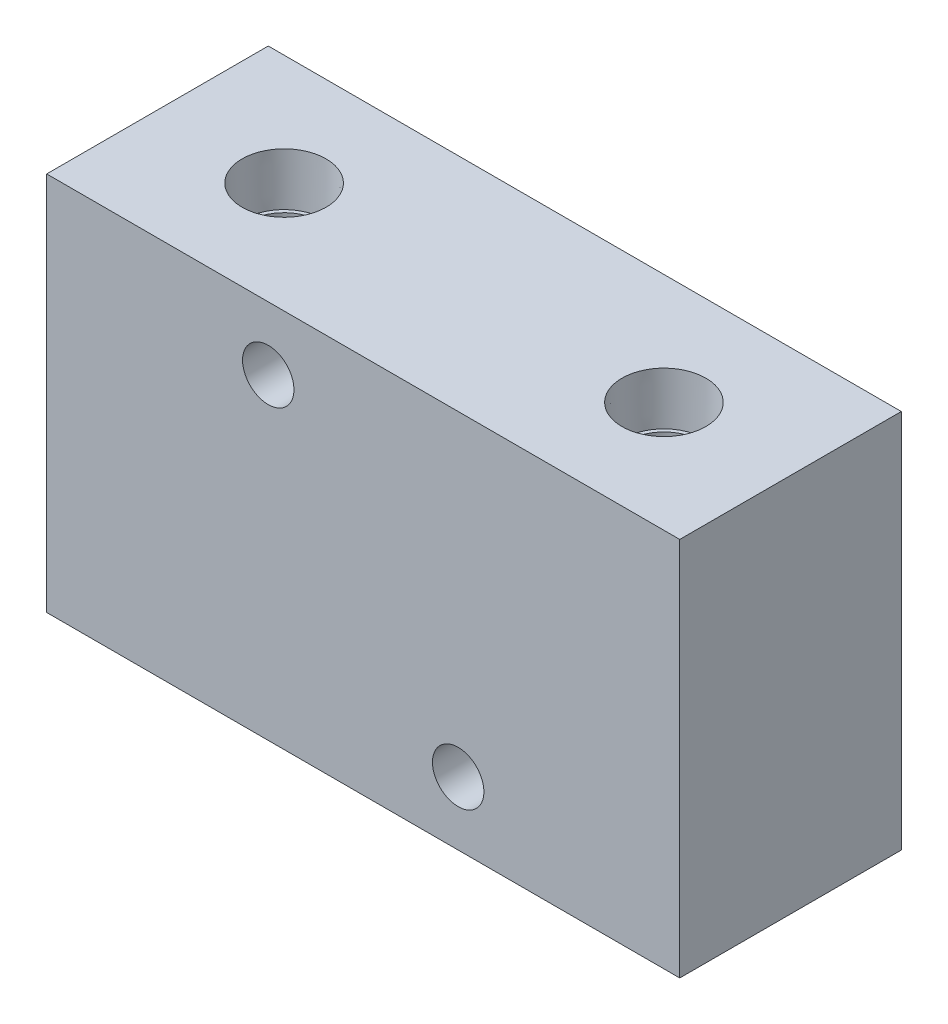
ISO-10303-21;
HEADER;
FILE_DESCRIPTION(('STEP AP214'),'2;1');
FILE_NAME('part.step','',(''),(''),'','','');
FILE_SCHEMA(('AUTOMOTIVE_DESIGN { 1 0 10303 214 1 1 1 1 }'));
ENDSEC;
DATA;
#1=APPLICATION_CONTEXT('core data for automotive mechanical design processes');
#2=APPLICATION_PROTOCOL_DEFINITION('international standard','automotive_design',2000,#1);
#3=PRODUCT_CONTEXT('',#1,'mechanical');
#4=PRODUCT('Part','Part','',(#3));
#5=PRODUCT_RELATED_PRODUCT_CATEGORY('part','',(#4));
#6=PRODUCT_DEFINITION_FORMATION('','',#4);
#7=PRODUCT_DEFINITION_CONTEXT('part definition',#1,'design');
#8=PRODUCT_DEFINITION('design','',#6,#7);
#9=PRODUCT_DEFINITION_SHAPE('','',#8);
#10=(LENGTH_UNIT() NAMED_UNIT(*) SI_UNIT(.MILLI.,.METRE.));
#11=(NAMED_UNIT(*) PLANE_ANGLE_UNIT() SI_UNIT($,.RADIAN.));
#12=(NAMED_UNIT(*) SI_UNIT($,.STERADIAN.) SOLID_ANGLE_UNIT());
#13=UNCERTAINTY_MEASURE_WITH_UNIT(LENGTH_MEASURE(1.E-05),#10,'distance_accuracy_value','');
#14=(GEOMETRIC_REPRESENTATION_CONTEXT(3) GLOBAL_UNCERTAINTY_ASSIGNED_CONTEXT((#13)) GLOBAL_UNIT_ASSIGNED_CONTEXT((#10,
#11,#12)) REPRESENTATION_CONTEXT('',''));
#15=CARTESIAN_POINT('',(0.,0.,0.));
#16=DIRECTION('',(0.,0.,1.));
#17=DIRECTION('',(1.,0.,0.));
#18=AXIS2_PLACEMENT_3D('',#15,#16,#17);
#19=CARTESIAN_POINT('',(-63.5,-38.1,44.45));
#20=DIRECTION('',(-1.,0.,0.));
#21=DIRECTION('',(0.,0.,1.));
#22=AXIS2_PLACEMENT_3D('',#19,#20,#21);
#23=PLANE('',#22);
#24=CARTESIAN_POINT('',(-63.4999999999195,0.,22.0996198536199));
#25=DIRECTION('',(-1.,0.,0.));
#26=DIRECTION('',(0.,0.,1.));
#27=AXIS2_PLACEMENT_3D('',#24,#25,#26);
#28=CIRCLE('',#27,10.47242);
#29=CARTESIAN_POINT('',(-63.4999999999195,0.,32.5720398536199));
#30=VERTEX_POINT('',#29);
#31=EDGE_CURVE('E99',#30,#30,#28,.T.);
#32=ORIENTED_EDGE('',*,*,#31,.F.);
#33=EDGE_LOOP('',(#32));
#34=FACE_BOUND('',#33,.T.);
#35=DIRECTION('',(0.,1.,0.));
#36=VECTOR('',#35,1.);
#37=CARTESIAN_POINT('',(-63.5,-38.1,0.));
#38=LINE('',#37,#36);
#39=CARTESIAN_POINT('',(-63.5,-38.1,0.));
#40=VERTEX_POINT('',#39);
#41=CARTESIAN_POINT('',(-63.5,38.1,0.));
#42=VERTEX_POINT('',#41);
#43=EDGE_CURVE('E111',#40,#42,#38,.T.);
#44=ORIENTED_EDGE('',*,*,#43,.F.);
#45=DIRECTION('',(0.,0.,-1.));
#46=VECTOR('',#45,1.);
#47=CARTESIAN_POINT('',(-63.5,-38.1,44.45));
#48=LINE('',#47,#46);
#49=CARTESIAN_POINT('',(-63.5,-38.1,44.45));
#50=VERTEX_POINT('',#49);
#51=EDGE_CURVE('E11',#50,#40,#48,.T.);
#52=ORIENTED_EDGE('',*,*,#51,.F.);
#53=DIRECTION('',(0.,1.,0.));
#54=VECTOR('',#53,1.);
#55=CARTESIAN_POINT('',(-63.5,-38.1,44.45));
#56=LINE('',#55,#54);
#57=CARTESIAN_POINT('',(-63.5,38.1,44.45));
#58=VERTEX_POINT('',#57);
#59=EDGE_CURVE('E112',#50,#58,#56,.T.);
#60=ORIENTED_EDGE('',*,*,#59,.T.);
#61=DIRECTION('',(0.,0.,-1.));
#62=VECTOR('',#61,1.);
#63=CARTESIAN_POINT('',(-63.5,38.1,44.45));
#64=LINE('',#63,#62);
#65=EDGE_CURVE('E120',#58,#42,#64,.T.);
#66=ORIENTED_EDGE('',*,*,#65,.T.);
#67=EDGE_LOOP('',(#44,#52,#60,#66));
#68=FACE_BOUND('',#67,.T.);
#69=ADVANCED_FACE('F34',(#34,#68),#23,.T.);
#70=CARTESIAN_POINT('',(-63.5,-38.1,44.45));
#71=DIRECTION('',(0.,1.,0.));
#72=DIRECTION('',(0.,0.,1.));
#73=AXIS2_PLACEMENT_3D('',#70,#71,#72);
#74=PLANE('',#73);
#75=CARTESIAN_POINT('',(-38.1000000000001,-38.1,22.225));
#76=DIRECTION('',(0.,-1.,0.));
#77=DIRECTION('',(0.,0.,-1.));
#78=AXIS2_PLACEMENT_3D('',#75,#76,#77);
#79=CIRCLE('',#78,8.41883000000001);
#80=CARTESIAN_POINT('',(-38.1000000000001,-38.1,13.80617));
#81=VERTEX_POINT('',#80);
#82=EDGE_CURVE('E374',#81,#81,#79,.T.);
#83=ORIENTED_EDGE('',*,*,#82,.F.);
#84=EDGE_LOOP('',(#83));
#85=FACE_BOUND('',#84,.T.);
#86=CARTESIAN_POINT('',(0.,-38.1,22.225));
#87=DIRECTION('',(0.,-1.,0.));
#88=DIRECTION('',(0.,0.,-1.));
#89=AXIS2_PLACEMENT_3D('',#86,#87,#88);
#90=CIRCLE('',#89,8.41883000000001);
#91=CARTESIAN_POINT('',(0.,-38.1,13.80617));
#92=VERTEX_POINT('',#91);
#93=EDGE_CURVE('E142',#92,#92,#90,.T.);
#94=ORIENTED_EDGE('',*,*,#93,.F.);
#95=EDGE_LOOP('',(#94));
#96=FACE_BOUND('',#95,.T.);
#97=CARTESIAN_POINT('',(38.1,-38.1000000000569,22.225));
#98=DIRECTION('',(0.,-1.,0.));
#99=DIRECTION('',(0.,0.,-1.));
#100=AXIS2_PLACEMENT_3D('',#97,#98,#99);
#101=CIRCLE('',#100,8.41883000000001);
#102=CARTESIAN_POINT('',(38.1,-38.1000000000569,13.80617));
#103=VERTEX_POINT('',#102);
#104=EDGE_CURVE('E102',#103,#103,#101,.T.);
#105=ORIENTED_EDGE('',*,*,#104,.F.);
#106=EDGE_LOOP('',(#105));
#107=FACE_BOUND('',#106,.T.);
#108=DIRECTION('',(1.,0.,0.));
#109=VECTOR('',#108,1.);
#110=CARTESIAN_POINT('',(-63.5,-38.1,0.));
#111=LINE('',#110,#109);
#112=CARTESIAN_POINT('',(63.5,-38.1,0.));
#113=VERTEX_POINT('',#112);
#114=EDGE_CURVE('E114',#40,#113,#111,.T.);
#115=ORIENTED_EDGE('',*,*,#114,.T.);
#116=DIRECTION('',(0.,0.,-1.));
#117=VECTOR('',#116,1.);
#118=CARTESIAN_POINT('',(63.5,-38.1,44.45));
#119=LINE('',#118,#117);
#120=CARTESIAN_POINT('',(63.5,-38.1,44.45));
#121=VERTEX_POINT('',#120);
#122=EDGE_CURVE('E43',#121,#113,#119,.T.);
#123=ORIENTED_EDGE('',*,*,#122,.F.);
#124=DIRECTION('',(1.,0.,0.));
#125=VECTOR('',#124,1.);
#126=CARTESIAN_POINT('',(-63.5,-38.1,44.45));
#127=LINE('',#126,#125);
#128=EDGE_CURVE('E118',#50,#121,#127,.T.);
#129=ORIENTED_EDGE('',*,*,#128,.F.);
#130=ORIENTED_EDGE('',*,*,#51,.T.);
#131=EDGE_LOOP('',(#115,#123,#129,#130));
#132=FACE_BOUND('',#131,.T.);
#133=ADVANCED_FACE('F175',(#85,#96,#107,#132),#74,.F.);
#134=CARTESIAN_POINT('',(63.5,38.1,44.45));
#135=DIRECTION('',(1.,0.,0.));
#136=DIRECTION('',(0.,1.,0.));
#137=AXIS2_PLACEMENT_3D('',#134,#135,#136);
#138=PLANE('',#137);
#139=DIRECTION('',(0.,-1.,0.));
#140=VECTOR('',#139,1.);
#141=CARTESIAN_POINT('',(63.5,38.1,0.));
#142=LINE('',#141,#140);
#143=CARTESIAN_POINT('',(63.5,38.1,0.));
#144=VERTEX_POINT('',#143);
#145=EDGE_CURVE('E126',#144,#113,#142,.T.);
#146=ORIENTED_EDGE('',*,*,#145,.F.);
#147=DIRECTION('',(0.,0.,-1.));
#148=VECTOR('',#147,1.);
#149=CARTESIAN_POINT('',(63.5,38.1,44.45));
#150=LINE('',#149,#148);
#151=CARTESIAN_POINT('',(63.5,38.1,44.45));
#152=VERTEX_POINT('',#151);
#153=EDGE_CURVE('E131',#152,#144,#150,.T.);
#154=ORIENTED_EDGE('',*,*,#153,.F.);
#155=DIRECTION('',(0.,-1.,0.));
#156=VECTOR('',#155,1.);
#157=CARTESIAN_POINT('',(63.5,38.1,44.45));
#158=LINE('',#157,#156);
#159=EDGE_CURVE('E116',#152,#121,#158,.T.);
#160=ORIENTED_EDGE('',*,*,#159,.T.);
#161=ORIENTED_EDGE('',*,*,#122,.T.);
#162=EDGE_LOOP('',(#146,#154,#160,#161));
#163=FACE_BOUND('',#162,.T.);
#164=ADVANCED_FACE('F180',(#163),#138,.T.);
#165=CARTESIAN_POINT('',(63.5,38.1,44.45));
#166=DIRECTION('',(0.,-1.,0.));
#167=DIRECTION('',(1.,0.,0.));
#168=AXIS2_PLACEMENT_3D('',#165,#166,#167);
#169=PLANE('',#168);
#170=CARTESIAN_POINT('',(-38.1000000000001,38.1,22.225));
#171=DIRECTION('',(0.,-1.,0.));
#172=DIRECTION('',(0.,0.,-1.));
#173=AXIS2_PLACEMENT_3D('',#170,#171,#172);
#174=CIRCLE('',#173,8.41883000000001);
#175=CARTESIAN_POINT('',(-38.1000000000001,38.1,13.80617));
#176=VERTEX_POINT('',#175);
#177=EDGE_CURVE('E340',#176,#176,#174,.T.);
#178=ORIENTED_EDGE('',*,*,#177,.T.);
#179=EDGE_LOOP('',(#178));
#180=FACE_BOUND('',#179,.T.);
#181=CARTESIAN_POINT('',(38.1,38.1000000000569,22.225));
#182=DIRECTION('',(0.,-1.,0.));
#183=DIRECTION('',(0.,0.,-1.));
#184=AXIS2_PLACEMENT_3D('',#181,#182,#183);
#185=CIRCLE('',#184,8.41883000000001);
#186=CARTESIAN_POINT('',(38.1,38.1000000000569,13.80617));
#187=VERTEX_POINT('',#186);
#188=EDGE_CURVE('E358',#187,#187,#185,.T.);
#189=ORIENTED_EDGE('',*,*,#188,.T.);
#190=EDGE_LOOP('',(#189));
#191=FACE_BOUND('',#190,.T.);
#192=DIRECTION('',(-1.,0.,0.));
#193=VECTOR('',#192,1.);
#194=CARTESIAN_POINT('',(63.5,38.1,0.));
#195=LINE('',#194,#193);
#196=EDGE_CURVE('E123',#144,#42,#195,.T.);
#197=ORIENTED_EDGE('',*,*,#196,.T.);
#198=ORIENTED_EDGE('',*,*,#65,.F.);
#199=DIRECTION('',(-1.,0.,0.));
#200=VECTOR('',#199,1.);
#201=CARTESIAN_POINT('',(63.5,38.1,44.45));
#202=LINE('',#201,#200);
#203=EDGE_CURVE('E79',#152,#58,#202,.T.);
#204=ORIENTED_EDGE('',*,*,#203,.F.);
#205=ORIENTED_EDGE('',*,*,#153,.T.);
#206=EDGE_LOOP('',(#197,#198,#204,#205));
#207=FACE_BOUND('',#206,.T.);
#208=ADVANCED_FACE('F189',(#180,#191,#207),#169,.F.);
#209=CARTESIAN_POINT('',(-63.5,-38.1,44.45));
#210=DIRECTION('',(0.,0.,-1.));
#211=DIRECTION('',(-1.,0.,0.));
#212=AXIS2_PLACEMENT_3D('',#209,#210,#211);
#213=PLANE('',#212);
#214=CARTESIAN_POINT('',(-19.05,25.4,44.45));
#215=DIRECTION('',(0.,0.,-1.));
#216=DIRECTION('',(-1.,0.,0.));
#217=AXIS2_PLACEMENT_3D('',#214,#215,#216);
#218=CIRCLE('',#217,5.1562);
#219=CARTESIAN_POINT('',(-24.2062,25.4,44.45));
#220=VERTEX_POINT('',#219);
#221=EDGE_CURVE('E536',#220,#220,#218,.T.);
#222=ORIENTED_EDGE('',*,*,#221,.T.);
#223=EDGE_LOOP('',(#222));
#224=FACE_BOUND('',#223,.T.);
#225=CARTESIAN_POINT('',(19.05,-25.4,44.45));
#226=DIRECTION('',(0.,0.,-1.));
#227=DIRECTION('',(-1.,0.,0.));
#228=AXIS2_PLACEMENT_3D('',#225,#226,#227);
#229=CIRCLE('',#228,5.1562);
#230=CARTESIAN_POINT('',(13.8938,-25.4,44.45));
#231=VERTEX_POINT('',#230);
#232=EDGE_CURVE('E532',#231,#231,#229,.T.);
#233=ORIENTED_EDGE('',*,*,#232,.T.);
#234=EDGE_LOOP('',(#233));
#235=FACE_BOUND('',#234,.T.);
#236=ORIENTED_EDGE('',*,*,#59,.F.);
#237=ORIENTED_EDGE('',*,*,#128,.T.);
#238=ORIENTED_EDGE('',*,*,#159,.F.);
#239=ORIENTED_EDGE('',*,*,#203,.T.);
#240=EDGE_LOOP('',(#236,#237,#238,#239));
#241=FACE_BOUND('',#240,.T.);
#242=ADVANCED_FACE('F187',(#224,#235,#241),#213,.F.);
#243=CARTESIAN_POINT('',(-63.5,-38.1,0.));
#244=DIRECTION('',(0.,0.,-1.));
#245=DIRECTION('',(-1.,0.,0.));
#246=AXIS2_PLACEMENT_3D('',#243,#244,#245);
#247=PLANE('',#246);
#248=CARTESIAN_POINT('',(-19.05,25.4,0.));
#249=DIRECTION('',(0.,0.,-1.));
#250=DIRECTION('',(-1.,0.,0.));
#251=AXIS2_PLACEMENT_3D('',#248,#249,#250);
#252=CIRCLE('',#251,5.1562);
#253=CARTESIAN_POINT('',(-24.2062,25.4,0.));
#254=VERTEX_POINT('',#253);
#255=EDGE_CURVE('E539',#254,#254,#252,.T.);
#256=ORIENTED_EDGE('',*,*,#255,.F.);
#257=EDGE_LOOP('',(#256));
#258=FACE_BOUND('',#257,.T.);
#259=CARTESIAN_POINT('',(19.05,-25.4,0.));
#260=DIRECTION('',(0.,0.,-1.));
#261=DIRECTION('',(-1.,0.,0.));
#262=AXIS2_PLACEMENT_3D('',#259,#260,#261);
#263=CIRCLE('',#262,5.1562);
#264=CARTESIAN_POINT('',(13.8938,-25.4,0.));
#265=VERTEX_POINT('',#264);
#266=EDGE_CURVE('E533',#265,#265,#263,.T.);
#267=ORIENTED_EDGE('',*,*,#266,.F.);
#268=EDGE_LOOP('',(#267));
#269=FACE_BOUND('',#268,.T.);
#270=ORIENTED_EDGE('',*,*,#43,.T.);
#271=ORIENTED_EDGE('',*,*,#196,.F.);
#272=ORIENTED_EDGE('',*,*,#145,.T.);
#273=ORIENTED_EDGE('',*,*,#114,.F.);
#274=EDGE_LOOP('',(#270,#271,#272,#273));
#275=FACE_BOUND('',#274,.T.);
#276=ADVANCED_FACE('F186',(#258,#269,#275),#247,.T.);
#277=CARTESIAN_POINT('',(-63.4999999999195,0.,22.0996198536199));
#278=DIRECTION('',(-1.,0.,0.));
#279=DIRECTION('',(0.,0.,1.));
#280=AXIS2_PLACEMENT_3D('',#277,#278,#279);
#281=CONICAL_SURFACE('',#280,10.47242,0.0311250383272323);
#282=CARTESIAN_POINT('',(-49.9287799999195,0.,22.0996198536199));
#283=DIRECTION('',(-1.,0.,0.));
#284=DIRECTION('',(0.,0.,1.));
#285=AXIS2_PLACEMENT_3D('',#282,#283,#284);
#286=CIRCLE('',#285,10.049878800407);
#287=CARTESIAN_POINT('',(-49.9287799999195,0.,32.1494986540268));
#288=VERTEX_POINT('',#287);
#289=EDGE_CURVE('E108',#288,#288,#286,.T.);
#290=ORIENTED_EDGE('',*,*,#289,.F.);
#291=EDGE_LOOP('',(#290));
#292=FACE_BOUND('',#291,.T.);
#293=ORIENTED_EDGE('',*,*,#31,.T.);
#294=EDGE_LOOP('',(#293));
#295=FACE_BOUND('',#294,.T.);
#296=ADVANCED_FACE('F196',(#292,#295),#281,.F.);
#297=CARTESIAN_POINT('',(-49.9287799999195,0.,22.0996198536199));
#298=DIRECTION('',(-1.,0.,0.));
#299=DIRECTION('',(0.,0.,1.));
#300=AXIS2_PLACEMENT_3D('',#297,#298,#299);
#301=PLANE('',#300);
#302=CARTESIAN_POINT('',(-49.9287799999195,0.,22.0996198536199));
#303=DIRECTION('',(-1.,0.,0.));
#304=DIRECTION('',(0.,0.,1.));
#305=AXIS2_PLACEMENT_3D('',#302,#303,#304);
#306=CIRCLE('',#305,8.92809999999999);
#307=CARTESIAN_POINT('',(-49.9287799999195,0.,31.0277198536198));
#308=VERTEX_POINT('',#307);
#309=EDGE_CURVE('E95',#308,#308,#306,.T.);
#310=ORIENTED_EDGE('',*,*,#309,.F.);
#311=EDGE_LOOP('',(#310));
#312=FACE_BOUND('',#311,.T.);
#313=ORIENTED_EDGE('',*,*,#289,.T.);
#314=EDGE_LOOP('',(#313));
#315=FACE_BOUND('',#314,.T.);
#316=ADVANCED_FACE('F229',(#312,#315),#301,.T.);
#317=CARTESIAN_POINT('',(50.7999999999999,0.,22.0996198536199));
#318=DIRECTION('',(-1.,0.,0.));
#319=DIRECTION('',(0.,0.,1.));
#320=AXIS2_PLACEMENT_3D('',#317,#318,#319);
#321=CYLINDRICAL_SURFACE('',#320,8.92809999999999);
#322=CARTESIAN_POINT('',(-38.1000000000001,5.25847621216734,14.8844));
#323=CARTESIAN_POINT('',(-38.2362279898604,5.25847474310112,14.8843993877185));
#324=CARTESIAN_POINT('',(-38.3724488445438,5.2637024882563,14.8882003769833));
#325=CARTESIAN_POINT('',(-38.6436836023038,5.28432931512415,14.9033017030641));
#326=CARTESIAN_POINT('',(-38.7786975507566,5.29972801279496,14.9146017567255));
#327=CARTESIAN_POINT('',(-39.0467681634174,5.33996930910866,14.9444594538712));
#328=CARTESIAN_POINT('',(-39.1798201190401,5.36483168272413,14.9630322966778));
#329=CARTESIAN_POINT('',(-39.4429869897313,5.42290806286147,15.0070630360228));
#330=CARTESIAN_POINT('',(-39.5730999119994,5.45612756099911,15.032525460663));
#331=CARTESIAN_POINT('',(-39.8761050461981,5.54292268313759,15.100263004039));
#332=CARTESIAN_POINT('',(-40.0475175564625,5.59952003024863,15.1452902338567));
#333=CARTESIAN_POINT('',(-40.3832685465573,5.72273605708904,15.2463285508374));
#334=CARTESIAN_POINT('',(-40.5476066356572,5.78935528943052,15.3023402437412));
#335=CARTESIAN_POINT('',(-40.8695919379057,5.93006666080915,15.4247419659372));
#336=CARTESIAN_POINT('',(-41.0272205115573,6.00417790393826,15.491158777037));
#337=CARTESIAN_POINT('',(-41.3354362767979,6.15742288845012,15.6337035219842));
#338=CARTESIAN_POINT('',(-41.4860236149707,6.23655652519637,15.7098312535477));
#339=CARTESIAN_POINT('',(-41.8351617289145,6.42801410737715,15.901544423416));
#340=CARTESIAN_POINT('',(-42.0306918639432,6.54172433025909,16.0212667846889));
#341=CARTESIAN_POINT('',(-42.409045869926,6.7710728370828,16.2778338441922));
#342=CARTESIAN_POINT('',(-42.5918650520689,6.88671181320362,16.4146848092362));
#343=CARTESIAN_POINT('',(-42.9443455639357,7.1165202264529,16.7051428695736));
#344=CARTESIAN_POINT('',(-43.1140183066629,7.2306908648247,16.8587351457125));
#345=CARTESIAN_POINT('',(-43.4396314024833,7.45472940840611,17.1826352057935));
#346=CARTESIAN_POINT('',(-43.595576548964,7.5645988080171,17.3529371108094));
#347=CARTESIAN_POINT('',(-43.8618643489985,7.75529518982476,17.6731587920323));
#348=CARTESIAN_POINT('',(-43.9749684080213,7.83742944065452,17.8200104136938));
#349=CARTESIAN_POINT('',(-44.1910206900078,7.99589662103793,18.1239483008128));
#350=CARTESIAN_POINT('',(-44.2939709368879,8.07223070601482,18.2810325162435));
#351=CARTESIAN_POINT('',(-44.4886692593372,8.21763496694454,18.6049210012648));
#352=CARTESIAN_POINT('',(-44.5804305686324,8.28671371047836,18.771713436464));
#353=CARTESIAN_POINT('',(-44.7518131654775,8.41631017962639,19.1146132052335));
#354=CARTESIAN_POINT('',(-44.8314364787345,8.47682933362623,19.2907189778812));
#355=CARTESIAN_POINT('',(-44.9655116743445,8.57888437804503,19.621986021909));
#356=CARTESIAN_POINT('',(-45.0219510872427,8.62190670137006,19.7758869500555));
#357=CARTESIAN_POINT('',(-45.1248537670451,8.70022692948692,20.0888902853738));
#358=CARTESIAN_POINT('',(-45.1713189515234,8.73552631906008,20.2479916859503));
#359=CARTESIAN_POINT('',(-45.253646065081,8.79770728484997,20.5704791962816));
#360=CARTESIAN_POINT('',(-45.2895114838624,8.8245916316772,20.7338638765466));
#361=CARTESIAN_POINT('',(-45.350132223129,8.86938538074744,21.0639062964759));
#362=CARTESIAN_POINT('',(-45.3748874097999,8.88729467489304,21.2305640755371));
#363=CARTESIAN_POINT('',(-45.4129690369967,8.91376943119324,21.5665360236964));
#364=CARTESIAN_POINT('',(-45.4262539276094,8.92230095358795,21.7358576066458));
#365=CARTESIAN_POINT('',(-45.4410369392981,8.92967973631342,22.0752276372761));
#366=CARTESIAN_POINT('',(-45.4425350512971,8.9285269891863,22.2452760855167));
#367=CARTESIAN_POINT('',(-45.4337464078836,8.91652909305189,22.5847186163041));
#368=CARTESIAN_POINT('',(-45.4234598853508,8.90568413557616,22.7541127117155));
#369=CARTESIAN_POINT('',(-45.3913116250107,8.87450928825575,23.0909095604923));
#370=CARTESIAN_POINT('',(-45.3694501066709,8.8541795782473,23.2583123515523));
#371=CARTESIAN_POINT('',(-45.3160920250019,8.80583790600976,23.5805766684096));
#372=CARTESIAN_POINT('',(-45.2852052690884,8.77832129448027,23.7356146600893));
#373=CARTESIAN_POINT('',(-45.2139141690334,8.71565849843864,24.0419695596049));
#374=CARTESIAN_POINT('',(-45.1735061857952,8.68050939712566,24.1932850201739));
#375=CARTESIAN_POINT('',(-45.0837080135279,8.60314950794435,24.4913769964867));
#376=CARTESIAN_POINT('',(-45.0343172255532,8.5609382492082,24.6381532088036));
#377=CARTESIAN_POINT('',(-44.9271260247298,8.4700790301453,24.9265621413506));
#378=CARTESIAN_POINT('',(-44.8693240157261,8.42142984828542,25.0681938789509));
#379=CARTESIAN_POINT('',(-44.7249509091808,8.3008643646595,25.3929360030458));
#380=CARTESIAN_POINT('',(-44.6352715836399,8.22665302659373,25.5738216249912));
#381=CARTESIAN_POINT('',(-44.4432188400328,8.06947794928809,25.9247326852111));
#382=CARTESIAN_POINT('',(-44.3408416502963,7.98651161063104,26.0947548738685));
#383=CARTESIAN_POINT('',(-44.1244843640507,7.81333356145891,26.4236657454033));
#384=CARTESIAN_POINT('',(-44.0104900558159,7.7231130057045,26.5825403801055));
#385=CARTESIAN_POINT('',(-43.7720392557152,7.53709719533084,26.8886928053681));
#386=CARTESIAN_POINT('',(-43.6475835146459,7.44130234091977,27.0359714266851));
#387=CARTESIAN_POINT('',(-43.3870666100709,7.2442163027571,27.3209957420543));
#388=CARTESIAN_POINT('',(-43.2508595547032,7.14286429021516,27.4585656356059));
#389=CARTESIAN_POINT('',(-42.9690651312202,6.93764715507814,27.7217066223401));
#390=CARTESIAN_POINT('',(-42.823477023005,6.83378183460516,27.8472767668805));
#391=CARTESIAN_POINT('',(-42.5232361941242,6.62528266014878,28.0864191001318));
#392=CARTESIAN_POINT('',(-42.3685820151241,6.52064868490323,28.1999893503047));
#393=CARTESIAN_POINT('',(-42.0503106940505,6.31261120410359,28.4150193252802));
#394=CARTESIAN_POINT('',(-41.8866949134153,6.209207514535,28.5164808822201));
#395=CARTESIAN_POINT('',(-41.5798252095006,6.02383420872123,28.690339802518));
#396=CARTESIAN_POINT('',(-41.4380374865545,5.94128789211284,28.7647128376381));
#397=CARTESIAN_POINT('',(-41.1479874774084,5.78026516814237,28.9048302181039));
#398=CARTESIAN_POINT('',(-40.9997246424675,5.70178910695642,28.9705738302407));
#399=CARTESIAN_POINT('',(-40.6966574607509,5.55103850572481,29.0929274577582));
#400=CARTESIAN_POINT('',(-40.5418623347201,5.47875563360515,29.1495498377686));
#401=CARTESIAN_POINT('',(-40.2254882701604,5.34282029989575,29.2531180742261));
#402=CARTESIAN_POINT('',(-40.063912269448,5.2791641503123,29.3000680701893));
#403=CARTESIAN_POINT('',(-39.6685581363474,5.14059720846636,29.3999739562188));
#404=CARTESIAN_POINT('',(-39.4314478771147,5.07115715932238,29.4479892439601));
#405=CARTESIAN_POINT('',(-39.0682134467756,4.99093145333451,29.5024983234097));
#406=CARTESIAN_POINT('',(-38.9459561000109,4.96818567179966,29.5177447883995));
#407=CARTESIAN_POINT('',(-38.6995352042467,4.93159517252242,29.5421213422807));
#408=CARTESIAN_POINT('',(-38.5753726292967,4.91774605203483,29.5512544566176));
#409=CARTESIAN_POINT('',(-38.3251126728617,4.89956034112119,29.5632248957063));
#410=CARTESIAN_POINT('',(-38.1990077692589,4.89529529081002,29.5660148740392));
#411=CARTESIAN_POINT('',(-37.9468806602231,4.89671259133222,29.565085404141));
#412=CARTESIAN_POINT('',(-37.820858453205,4.90239474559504,29.5613660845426));
#413=CARTESIAN_POINT('',(-37.5698580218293,4.9234169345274,29.5475115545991));
#414=CARTESIAN_POINT('',(-37.4448810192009,4.93876700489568,29.5373696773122));
#415=CARTESIAN_POINT('',(-37.1969671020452,4.97838295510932,29.5109109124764));
#416=CARTESIAN_POINT('',(-37.0740313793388,5.00265386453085,29.4945905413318));
#417=CARTESIAN_POINT('',(-36.7994927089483,5.06635873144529,29.4511382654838));
#418=CARTESIAN_POINT('',(-36.6486936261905,5.10809046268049,29.4223021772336));
#419=CARTESIAN_POINT('',(-36.3521854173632,5.20169847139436,29.356105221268));
#420=CARTESIAN_POINT('',(-36.2064791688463,5.25358037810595,29.3187396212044));
#421=CARTESIAN_POINT('',(-35.9200722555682,5.36538910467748,29.2360344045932));
#422=CARTESIAN_POINT('',(-35.7793862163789,5.42533733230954,29.1906734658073));
#423=CARTESIAN_POINT('',(-35.5034293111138,5.55120153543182,29.0925810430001));
#424=CARTESIAN_POINT('',(-35.3681577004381,5.61711668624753,29.0398505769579));
#425=CARTESIAN_POINT('',(-35.0259914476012,5.79270399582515,28.8948339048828));
#426=CARTESIAN_POINT('',(-34.8229630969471,5.9056188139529,28.7973191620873));
#427=CARTESIAN_POINT('',(-34.4291477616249,6.13723482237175,28.5857574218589));
#428=CARTESIAN_POINT('',(-34.2383672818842,6.25593902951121,28.4717017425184));
#429=CARTESIAN_POINT('',(-33.8685199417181,6.49548008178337,28.227345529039));
#430=CARTESIAN_POINT('',(-33.6894672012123,6.61631928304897,28.0970259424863));
#431=CARTESIAN_POINT('',(-33.3434415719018,6.85690494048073,27.820409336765));
#432=CARTESIAN_POINT('',(-33.1764663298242,6.97665160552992,27.6741154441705));
#433=CARTESIAN_POINT('',(-32.8508123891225,7.21555591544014,27.3614128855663));
#434=CARTESIAN_POINT('',(-32.6924733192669,7.3346128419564,27.1945721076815));
#435=CARTESIAN_POINT('',(-32.3901235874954,7.56609662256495,26.8440139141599));
#436=CARTESIAN_POINT('',(-32.2461155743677,7.6785222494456,26.6602933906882));
#437=CARTESIAN_POINT('',(-31.974430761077,7.89370414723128,26.2767746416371));
#438=CARTESIAN_POINT('',(-31.8467090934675,7.99648676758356,26.0770231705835));
#439=CARTESIAN_POINT('',(-31.6091740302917,8.18994110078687,25.6616748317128));
#440=CARTESIAN_POINT('',(-31.4993501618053,8.28061989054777,25.4460873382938));
#441=CARTESIAN_POINT('',(-31.3328646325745,8.41957208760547,25.0740396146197));
#442=CARTESIAN_POINT('',(-31.2706277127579,8.4719567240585,24.9215811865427));
#443=CARTESIAN_POINT('',(-31.1559285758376,8.56923550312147,24.6107294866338));
#444=CARTESIAN_POINT('',(-31.1034636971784,8.61413168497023,24.4523378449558));
#445=CARTESIAN_POINT('',(-31.009036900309,8.6956436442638,24.1304570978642));
#446=CARTESIAN_POINT('',(-30.9670696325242,8.73226363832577,23.9669706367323));
#447=CARTESIAN_POINT('',(-30.8942519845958,8.79656646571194,23.6357957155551));
#448=CARTESIAN_POINT('',(-30.8634019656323,8.82424900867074,23.4681071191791));
#449=CARTESIAN_POINT('',(-30.8132320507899,8.87023529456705,23.1288615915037));
#450=CARTESIAN_POINT('',(-30.7939705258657,8.88849149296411,22.9572895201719));
#451=CARTESIAN_POINT('',(-30.7675926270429,8.91503705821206,22.6124426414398));
#452=CARTESIAN_POINT('',(-30.7604762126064,8.92332645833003,22.4391678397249));
#453=CARTESIAN_POINT('',(-30.7585502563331,8.92978115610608,22.0923773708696));
#454=CARTESIAN_POINT('',(-30.7637395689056,8.92794739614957,21.918861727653));
#455=CARTESIAN_POINT('',(-30.7863568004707,8.91423710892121,21.5730375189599));
#456=CARTESIAN_POINT('',(-30.8037841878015,8.90236101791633,21.4007289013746));
#457=CARTESIAN_POINT('',(-30.8488274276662,8.87013818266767,21.0715726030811));
#458=CARTESIAN_POINT('',(-30.8755793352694,8.85049496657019,20.9145360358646));
#459=CARTESIAN_POINT('',(-30.9389429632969,8.80327826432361,20.603627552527));
#460=CARTESIAN_POINT('',(-30.9755580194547,8.77570209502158,20.4497567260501));
#461=CARTESIAN_POINT('',(-31.0581636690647,8.7131435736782,20.1461295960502));
#462=CARTESIAN_POINT('',(-31.1041528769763,8.67816231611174,19.9963726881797));
#463=CARTESIAN_POINT('',(-31.2049867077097,8.60138049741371,19.7016140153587));
#464=CARTESIAN_POINT('',(-31.2598347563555,8.55957729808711,19.556614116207));
#465=CARTESIAN_POINT('',(-31.3818886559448,8.46670839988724,19.2621442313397));
#466=CARTESIAN_POINT('',(-31.4496868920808,8.41520200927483,19.1130588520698));
#467=CARTESIAN_POINT('',(-31.594056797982,8.30598383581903,18.8215322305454));
#468=CARTESIAN_POINT('',(-31.6706315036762,8.24826990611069,18.6790933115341));
#469=CARTESIAN_POINT('',(-31.9124315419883,8.06715844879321,18.2624963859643));
#470=CARTESIAN_POINT('',(-32.0898397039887,7.93570879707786,17.9988042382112));
#471=CARTESIAN_POINT('',(-32.5099041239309,7.63097277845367,17.4525559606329));
#472=CARTESIAN_POINT('',(-32.7585363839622,7.45453001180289,17.1763782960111));
#473=CARTESIAN_POINT('',(-33.1576961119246,7.18258800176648,16.7943371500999));
#474=CARTESIAN_POINT('',(-33.2953999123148,7.09054884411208,16.6721630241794));
#475=CARTESIAN_POINT('',(-33.5792257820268,6.90562058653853,16.4387440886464));
#476=CARTESIAN_POINT('',(-33.7253459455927,6.81273168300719,16.3274968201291));
#477=CARTESIAN_POINT('',(-34.0586473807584,6.60758557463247,16.0929527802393));
#478=CARTESIAN_POINT('',(-34.2478322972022,6.49552376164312,15.9723217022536));
#479=CARTESIAN_POINT('',(-34.6386793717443,6.27611615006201,15.7477717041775));
#480=CARTESIAN_POINT('',(-34.8403482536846,6.16877294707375,15.6438619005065));
#481=CARTESIAN_POINT('',(-35.255705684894,5.96374087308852,15.454004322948));
#482=CARTESIAN_POINT('',(-35.469350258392,5.86601990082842,15.3679956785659));
#483=CARTESIAN_POINT('',(-35.9094068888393,5.68570398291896,15.21502011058));
#484=CARTESIAN_POINT('',(-36.1358029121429,5.60309057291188,15.1480298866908));
#485=CARTESIAN_POINT('',(-36.5062345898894,5.48915836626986,15.0580961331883));
#486=CARTESIAN_POINT('',(-36.6464110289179,5.45062840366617,15.028309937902));
#487=CARTESIAN_POINT('',(-36.9304459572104,5.38305454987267,14.9767340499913));
#488=CARTESIAN_POINT('',(-37.0743024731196,5.35400568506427,14.9549401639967));
#489=CARTESIAN_POINT('',(-37.3643789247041,5.30692071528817,14.9198963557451));
#490=CARTESIAN_POINT('',(-37.5105897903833,5.28884955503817,14.9066192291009));
#491=CARTESIAN_POINT('',(-37.8045366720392,5.26462870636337,14.8888718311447));
#492=CARTESIAN_POINT('',(-37.9522725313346,5.25847780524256,14.8844006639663));
#493=CARTESIAN_POINT('',(-38.1000000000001,5.25847621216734,14.8844));
#494=B_SPLINE_CURVE_WITH_KNOTS('',3,(#322,#323,#324,#325,#326,#327,#328,#329,#330,#331,#332,
#333,#334,#335,#336,#337,#338,#339,#340,#341,#342,#343,#344,#345,#346,#347,#348,#349,#350,#351,
#352,#353,#354,#355,#356,#357,#358,#359,#360,#361,#362,#363,#364,#365,#366,#367,#368,#369,#370,
#371,#372,#373,#374,#375,#376,#377,#378,#379,#380,#381,#382,#383,#384,#385,#386,#387,#388,#389,
#390,#391,#392,#393,#394,#395,#396,#397,#398,#399,#400,#401,#402,#403,#404,#405,#406,#407,#408,
#409,#410,#411,#412,#413,#414,#415,#416,#417,#418,#419,#420,#421,#422,#423,#424,#425,#426,#427,
#428,#429,#430,#431,#432,#433,#434,#435,#436,#437,#438,#439,#440,#441,#442,#443,#444,#445,#446,
#447,#448,#449,#450,#451,#452,#453,#454,#455,#456,#457,#458,#459,#460,#461,#462,#463,#464,#465,
#466,#467,#468,#469,#470,#471,#472,#473,#474,#475,#476,#477,#478,#479,#480,#481,#482,#483,#484,
#485,#486,#487,#488,#489,#490,#491,#492,#493),.UNSPECIFIED.,.T.,.F.,(4,2,2,2,2,2,2,2,2,2,2,2,2,
2,2,2,2,2,2,2,2,2,2,2,2,2,2,2,2,2,2,2,2,2,2,2,2,2,2,2,2,2,2,2,2,2,2,2,2,2,2,2,2,2,2,2,2,2,2,2,2,
2,2,2,2,2,2,2,2,2,2,2,2,2,2,2,2,2,2,2,2,2,2,2,2,4),(0.,0.408522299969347,0.817029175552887,
1.22639438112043,1.63602929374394,2.19327437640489,2.75055019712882,3.3092847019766,
3.86800756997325,4.63478584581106,5.40184548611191,6.16823156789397,6.93434897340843,
7.5420331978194,8.14959604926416,8.75643318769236,9.36316894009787,9.87108430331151,
10.3789019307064,10.8865521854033,11.3942085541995,11.9036962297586,12.4131842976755,
12.9226622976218,13.4321306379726,13.9129976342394,14.3940487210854,14.8751318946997,
15.356306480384,16.0006835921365,16.6452525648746,17.2906197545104,17.9359406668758,
18.5909260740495,19.2459632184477,19.901106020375,20.5561495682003,21.0962276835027,
21.6363516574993,22.1757371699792,22.7148913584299,23.4667955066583,23.8422575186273,
24.217533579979,24.595601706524,24.9736623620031,25.3521161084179,25.7307835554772,
26.2073311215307,26.6841437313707,27.162247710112,27.6402857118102,28.3950370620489,
29.1501860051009,29.9062280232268,30.6621223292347,31.438158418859,32.2143376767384,
32.9883301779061,33.7618681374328,34.2798011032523,34.7975927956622,35.3151200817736,
35.832664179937,36.3527937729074,36.8729216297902,37.3930010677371,37.9130579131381,
38.3940381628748,38.8751812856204,39.3562533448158,39.8375118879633,40.3520606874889,
40.8667880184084,41.8953878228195,43.1249322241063,43.7420150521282,44.3589586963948,
45.1104902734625,45.8624302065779,46.6117699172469,47.3601875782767,47.8049003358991,
48.2493794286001,48.6924315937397,49.1354386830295),.UNSPECIFIED.);
#495=CARTESIAN_POINT('',(-38.1000000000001,5.25847621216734,14.8844));
#496=VERTEX_POINT('',#495);
#497=EDGE_CURVE('E333',#496,#496,#494,.T.);
#498=ORIENTED_EDGE('',*,*,#497,.T.);
#499=EDGE_LOOP('',(#498));
#500=FACE_BOUND('',#499,.T.);
#501=CARTESIAN_POINT('',(38.1,5.25847621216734,14.8844));
#502=CARTESIAN_POINT('',(38.2362279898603,5.25847474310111,14.8843993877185));
#503=CARTESIAN_POINT('',(38.3724488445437,5.2637024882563,14.8882003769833));
#504=CARTESIAN_POINT('',(38.6436836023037,5.28432931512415,14.9033017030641));
#505=CARTESIAN_POINT('',(38.7786975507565,5.29972801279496,14.9146017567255));
#506=CARTESIAN_POINT('',(39.0467681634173,5.33996930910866,14.9444594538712));
#507=CARTESIAN_POINT('',(39.17982011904,5.36483168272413,14.9630322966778));
#508=CARTESIAN_POINT('',(39.4429869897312,5.42290806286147,15.0070630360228));
#509=CARTESIAN_POINT('',(39.5730999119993,5.45612756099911,15.032525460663));
#510=CARTESIAN_POINT('',(39.876105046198,5.54292268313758,15.100263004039));
#511=CARTESIAN_POINT('',(40.0475175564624,5.59952003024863,15.1452902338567));
#512=CARTESIAN_POINT('',(40.3832685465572,5.72273605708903,15.2463285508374));
#513=CARTESIAN_POINT('',(40.5476066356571,5.78935528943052,15.3023402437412));
#514=CARTESIAN_POINT('',(40.8695919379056,5.93006666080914,15.4247419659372));
#515=CARTESIAN_POINT('',(41.0272205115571,6.00417790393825,15.491158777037));
#516=CARTESIAN_POINT('',(41.3354362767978,6.15742288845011,15.6337035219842));
#517=CARTESIAN_POINT('',(41.4860236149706,6.23655652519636,15.7098312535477));
#518=CARTESIAN_POINT('',(41.8351617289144,6.42801410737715,15.901544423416));
#519=CARTESIAN_POINT('',(42.030691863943,6.54172433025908,16.0212667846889));
#520=CARTESIAN_POINT('',(42.4090458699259,6.77107283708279,16.2778338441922));
#521=CARTESIAN_POINT('',(42.5918650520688,6.88671181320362,16.4146848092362));
#522=CARTESIAN_POINT('',(42.9443455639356,7.1165202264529,16.7051428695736));
#523=CARTESIAN_POINT('',(43.1140183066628,7.23069086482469,16.8587351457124));
#524=CARTESIAN_POINT('',(43.4396314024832,7.45472940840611,17.1826352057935));
#525=CARTESIAN_POINT('',(43.5955765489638,7.56459880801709,17.3529371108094));
#526=CARTESIAN_POINT('',(43.8618643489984,7.75529518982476,17.6731587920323));
#527=CARTESIAN_POINT('',(43.9749684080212,7.83742944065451,17.8200104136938));
#528=CARTESIAN_POINT('',(44.1910206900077,7.99589662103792,18.1239483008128));
#529=CARTESIAN_POINT('',(44.2939709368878,8.07223070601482,18.2810325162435));
#530=CARTESIAN_POINT('',(44.4886692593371,8.21763496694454,18.6049210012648));
#531=CARTESIAN_POINT('',(44.5804305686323,8.28671371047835,18.771713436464));
#532=CARTESIAN_POINT('',(44.7518131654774,8.41631017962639,19.1146132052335));
#533=CARTESIAN_POINT('',(44.8314364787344,8.47682933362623,19.2907189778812));
#534=CARTESIAN_POINT('',(44.9655116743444,8.57888437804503,19.621986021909));
#535=CARTESIAN_POINT('',(45.0219510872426,8.62190670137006,19.7758869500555));
#536=CARTESIAN_POINT('',(45.124853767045,8.70022692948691,20.0888902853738));
#537=CARTESIAN_POINT('',(45.1713189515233,8.73552631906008,20.2479916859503));
#538=CARTESIAN_POINT('',(45.2536460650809,8.79770728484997,20.5704791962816));
#539=CARTESIAN_POINT('',(45.2895114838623,8.82459163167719,20.7338638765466));
#540=CARTESIAN_POINT('',(45.3501322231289,8.86938538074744,21.0639062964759));
#541=CARTESIAN_POINT('',(45.3748874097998,8.88729467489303,21.230564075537));
#542=CARTESIAN_POINT('',(45.4129690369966,8.91376943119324,21.5665360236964));
#543=CARTESIAN_POINT('',(45.4262539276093,8.92230095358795,21.7358576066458));
#544=CARTESIAN_POINT('',(45.441036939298,8.92967973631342,22.0752276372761));
#545=CARTESIAN_POINT('',(45.442535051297,8.9285269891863,22.2452760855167));
#546=CARTESIAN_POINT('',(45.4337464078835,8.91652909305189,22.5847186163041));
#547=CARTESIAN_POINT('',(45.4234598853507,8.90568413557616,22.7541127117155));
#548=CARTESIAN_POINT('',(45.3913116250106,8.87450928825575,23.0909095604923));
#549=CARTESIAN_POINT('',(45.3694501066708,8.8541795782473,23.2583123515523));
#550=CARTESIAN_POINT('',(45.3160920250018,8.80583790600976,23.5805766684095));
#551=CARTESIAN_POINT('',(45.2852052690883,8.77832129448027,23.7356146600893));
#552=CARTESIAN_POINT('',(45.2139141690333,8.71565849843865,24.0419695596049));
#553=CARTESIAN_POINT('',(45.1735061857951,8.68050939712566,24.1932850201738));
#554=CARTESIAN_POINT('',(45.0837080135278,8.60314950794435,24.4913769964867));
#555=CARTESIAN_POINT('',(45.0343172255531,8.56093824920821,24.6381532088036));
#556=CARTESIAN_POINT('',(44.9271260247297,8.47007903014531,24.9265621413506));
#557=CARTESIAN_POINT('',(44.8693240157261,8.42142984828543,25.0681938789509));
#558=CARTESIAN_POINT('',(44.7249509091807,8.3008643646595,25.3929360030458));
#559=CARTESIAN_POINT('',(44.6352715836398,8.22665302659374,25.5738216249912));
#560=CARTESIAN_POINT('',(44.4432188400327,8.06947794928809,25.9247326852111));
#561=CARTESIAN_POINT('',(44.3408416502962,7.98651161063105,26.0947548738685));
#562=CARTESIAN_POINT('',(44.1244843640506,7.81333356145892,26.4236657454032));
#563=CARTESIAN_POINT('',(44.0104900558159,7.72311300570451,26.5825403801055));
#564=CARTESIAN_POINT('',(43.7720392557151,7.53709719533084,26.8886928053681));
#565=CARTESIAN_POINT('',(43.6475835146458,7.44130234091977,27.0359714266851));
#566=CARTESIAN_POINT('',(43.3870666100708,7.24421630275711,27.3209957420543));
#567=CARTESIAN_POINT('',(43.2508595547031,7.14286429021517,27.4585656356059));
#568=CARTESIAN_POINT('',(42.9690651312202,6.93764715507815,27.7217066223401));
#569=CARTESIAN_POINT('',(42.8234770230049,6.83378183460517,27.8472767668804));
#570=CARTESIAN_POINT('',(42.5232361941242,6.62528266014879,28.0864191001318));
#571=CARTESIAN_POINT('',(42.368582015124,6.52064868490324,28.1999893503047));
#572=CARTESIAN_POINT('',(42.0503106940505,6.3126112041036,28.4150193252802));
#573=CARTESIAN_POINT('',(41.8866949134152,6.20920751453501,28.5164808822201));
#574=CARTESIAN_POINT('',(41.5798252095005,6.02383420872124,28.690339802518));
#575=CARTESIAN_POINT('',(41.4380374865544,5.94128789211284,28.7647128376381));
#576=CARTESIAN_POINT('',(41.1479874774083,5.78026516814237,28.9048302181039));
#577=CARTESIAN_POINT('',(40.9997246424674,5.70178910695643,28.9705738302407));
#578=CARTESIAN_POINT('',(40.6966574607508,5.55103850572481,29.0929274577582));
#579=CARTESIAN_POINT('',(40.54186233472,5.47875563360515,29.1495498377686));
#580=CARTESIAN_POINT('',(40.2254882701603,5.34282029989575,29.2531180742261));
#581=CARTESIAN_POINT('',(40.0639122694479,5.27916415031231,29.3000680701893));
#582=CARTESIAN_POINT('',(39.6685581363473,5.14059720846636,29.3999739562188));
#583=CARTESIAN_POINT('',(39.4314478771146,5.07115715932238,29.4479892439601));
#584=CARTESIAN_POINT('',(39.0682134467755,4.99093145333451,29.5024983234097));
#585=CARTESIAN_POINT('',(38.9459561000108,4.96818567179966,29.5177447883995));
#586=CARTESIAN_POINT('',(38.6995352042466,4.93159517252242,29.5421213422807));
#587=CARTESIAN_POINT('',(38.5753726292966,4.91774605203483,29.5512544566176));
#588=CARTESIAN_POINT('',(38.3251126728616,4.89956034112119,29.5632248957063));
#589=CARTESIAN_POINT('',(38.1990077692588,4.89529529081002,29.5660148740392));
#590=CARTESIAN_POINT('',(37.946880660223,4.89671259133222,29.565085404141));
#591=CARTESIAN_POINT('',(37.8208584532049,4.90239474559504,29.5613660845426));
#592=CARTESIAN_POINT('',(37.5698580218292,4.9234169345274,29.5475115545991));
#593=CARTESIAN_POINT('',(37.4448810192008,4.93876700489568,29.5373696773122));
#594=CARTESIAN_POINT('',(37.1969671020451,4.97838295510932,29.5109109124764));
#595=CARTESIAN_POINT('',(37.0740313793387,5.00265386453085,29.4945905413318));
#596=CARTESIAN_POINT('',(36.7994927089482,5.06635873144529,29.4511382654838));
#597=CARTESIAN_POINT('',(36.6486936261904,5.10809046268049,29.4223021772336));
#598=CARTESIAN_POINT('',(36.3521854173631,5.20169847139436,29.356105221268));
#599=CARTESIAN_POINT('',(36.2064791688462,5.25358037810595,29.3187396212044));
#600=CARTESIAN_POINT('',(35.9200722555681,5.36538910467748,29.2360344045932));
#601=CARTESIAN_POINT('',(35.7793862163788,5.42533733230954,29.1906734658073));
#602=CARTESIAN_POINT('',(35.5034293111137,5.55120153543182,29.0925810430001));
#603=CARTESIAN_POINT('',(35.368157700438,5.61711668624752,29.0398505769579));
#604=CARTESIAN_POINT('',(35.0259914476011,5.79270399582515,28.8948339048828));
#605=CARTESIAN_POINT('',(34.822963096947,5.9056188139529,28.7973191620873));
#606=CARTESIAN_POINT('',(34.4291477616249,6.13723482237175,28.5857574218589));
#607=CARTESIAN_POINT('',(34.2383672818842,6.2559390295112,28.4717017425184));
#608=CARTESIAN_POINT('',(33.868519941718,6.49548008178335,28.227345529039));
#609=CARTESIAN_POINT('',(33.6894672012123,6.61631928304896,28.0970259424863));
#610=CARTESIAN_POINT('',(33.3434415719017,6.85690494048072,27.820409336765));
#611=CARTESIAN_POINT('',(33.1764663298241,6.9766516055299,27.6741154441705));
#612=CARTESIAN_POINT('',(32.8508123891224,7.21555591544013,27.3614128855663));
#613=CARTESIAN_POINT('',(32.6924733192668,7.3346128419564,27.1945721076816));
#614=CARTESIAN_POINT('',(32.3901235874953,7.56609662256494,26.8440139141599));
#615=CARTESIAN_POINT('',(32.2461155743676,7.67852224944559,26.6602933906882));
#616=CARTESIAN_POINT('',(31.9744307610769,7.89370414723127,26.2767746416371));
#617=CARTESIAN_POINT('',(31.8467090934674,7.99648676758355,26.0770231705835));
#618=CARTESIAN_POINT('',(31.6091740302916,8.18994110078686,25.6616748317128));
#619=CARTESIAN_POINT('',(31.4993501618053,8.28061989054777,25.4460873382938));
#620=CARTESIAN_POINT('',(31.3328646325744,8.41957208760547,25.0740396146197));
#621=CARTESIAN_POINT('',(31.2706277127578,8.47195672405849,24.9215811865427));
#622=CARTESIAN_POINT('',(31.1559285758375,8.56923550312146,24.6107294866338));
#623=CARTESIAN_POINT('',(31.1034636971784,8.61413168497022,24.4523378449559));
#624=CARTESIAN_POINT('',(31.0090369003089,8.6956436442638,24.1304570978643));
#625=CARTESIAN_POINT('',(30.9670696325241,8.73226363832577,23.9669706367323));
#626=CARTESIAN_POINT('',(30.8942519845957,8.79656646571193,23.6357957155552));
#627=CARTESIAN_POINT('',(30.8634019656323,8.82424900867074,23.4681071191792));
#628=CARTESIAN_POINT('',(30.8132320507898,8.87023529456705,23.1288615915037));
#629=CARTESIAN_POINT('',(30.7939705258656,8.8884914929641,22.9572895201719));
#630=CARTESIAN_POINT('',(30.7675926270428,8.91503705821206,22.6124426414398));
#631=CARTESIAN_POINT('',(30.7604762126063,8.92332645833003,22.4391678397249));
#632=CARTESIAN_POINT('',(30.758550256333,8.92978115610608,22.0923773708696));
#633=CARTESIAN_POINT('',(30.7637395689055,8.92794739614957,21.918861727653));
#634=CARTESIAN_POINT('',(30.7863568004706,8.91423710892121,21.5730375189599));
#635=CARTESIAN_POINT('',(30.8037841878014,8.90236101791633,21.4007289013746));
#636=CARTESIAN_POINT('',(30.8488274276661,8.87013818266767,21.0715726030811));
#637=CARTESIAN_POINT('',(30.8755793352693,8.85049496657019,20.9145360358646));
#638=CARTESIAN_POINT('',(30.9389429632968,8.80327826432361,20.603627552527));
#639=CARTESIAN_POINT('',(30.9755580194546,8.77570209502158,20.4497567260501));
#640=CARTESIAN_POINT('',(31.0581636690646,8.7131435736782,20.1461295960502));
#641=CARTESIAN_POINT('',(31.1041528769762,8.67816231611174,19.9963726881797));
#642=CARTESIAN_POINT('',(31.2049867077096,8.60138049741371,19.7016140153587));
#643=CARTESIAN_POINT('',(31.2598347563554,8.55957729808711,19.556614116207));
#644=CARTESIAN_POINT('',(31.3818886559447,8.46670839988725,19.2621442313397));
#645=CARTESIAN_POINT('',(31.4496868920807,8.41520200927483,19.1130588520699));
#646=CARTESIAN_POINT('',(31.5940567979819,8.30598383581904,18.8215322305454));
#647=CARTESIAN_POINT('',(31.6706315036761,8.24826990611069,18.6790933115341));
#648=CARTESIAN_POINT('',(31.9124315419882,8.06715844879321,18.2624963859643));
#649=CARTESIAN_POINT('',(32.0898397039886,7.93570879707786,17.9988042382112));
#650=CARTESIAN_POINT('',(32.5099041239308,7.63097277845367,17.4525559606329));
#651=CARTESIAN_POINT('',(32.7585363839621,7.4545300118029,17.1763782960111));
#652=CARTESIAN_POINT('',(33.1576961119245,7.18258800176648,16.7943371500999));
#653=CARTESIAN_POINT('',(33.2953999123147,7.09054884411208,16.6721630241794));
#654=CARTESIAN_POINT('',(33.5792257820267,6.90562058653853,16.4387440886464));
#655=CARTESIAN_POINT('',(33.7253459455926,6.81273168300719,16.3274968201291));
#656=CARTESIAN_POINT('',(34.0586473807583,6.60758557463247,16.0929527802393));
#657=CARTESIAN_POINT('',(34.2478322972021,6.49552376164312,15.9723217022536));
#658=CARTESIAN_POINT('',(34.6386793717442,6.27611615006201,15.7477717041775));
#659=CARTESIAN_POINT('',(34.8403482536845,6.16877294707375,15.6438619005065));
#660=CARTESIAN_POINT('',(35.2557056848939,5.96374087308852,15.454004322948));
#661=CARTESIAN_POINT('',(35.4693502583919,5.86601990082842,15.3679956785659));
#662=CARTESIAN_POINT('',(35.9094068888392,5.68570398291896,15.21502011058));
#663=CARTESIAN_POINT('',(36.1358029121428,5.60309057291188,15.1480298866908));
#664=CARTESIAN_POINT('',(36.5062345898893,5.48915836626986,15.0580961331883));
#665=CARTESIAN_POINT('',(36.6464110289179,5.45062840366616,15.028309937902));
#666=CARTESIAN_POINT('',(36.9304459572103,5.38305454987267,14.9767340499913));
#667=CARTESIAN_POINT('',(37.0743024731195,5.35400568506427,14.9549401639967));
#668=CARTESIAN_POINT('',(37.364378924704,5.30692071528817,14.9198963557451));
#669=CARTESIAN_POINT('',(37.5105897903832,5.28884955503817,14.9066192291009));
#670=CARTESIAN_POINT('',(37.8045366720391,5.26462870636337,14.8888718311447));
#671=CARTESIAN_POINT('',(37.9522725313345,5.25847780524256,14.8844006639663));
#672=CARTESIAN_POINT('',(38.1,5.25847621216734,14.8844));
#673=B_SPLINE_CURVE_WITH_KNOTS('',3,(#501,#502,#503,#504,#505,#506,#507,#508,#509,#510,#511,
#512,#513,#514,#515,#516,#517,#518,#519,#520,#521,#522,#523,#524,#525,#526,#527,#528,#529,#530,
#531,#532,#533,#534,#535,#536,#537,#538,#539,#540,#541,#542,#543,#544,#545,#546,#547,#548,#549,
#550,#551,#552,#553,#554,#555,#556,#557,#558,#559,#560,#561,#562,#563,#564,#565,#566,#567,#568,
#569,#570,#571,#572,#573,#574,#575,#576,#577,#578,#579,#580,#581,#582,#583,#584,#585,#586,#587,
#588,#589,#590,#591,#592,#593,#594,#595,#596,#597,#598,#599,#600,#601,#602,#603,#604,#605,#606,
#607,#608,#609,#610,#611,#612,#613,#614,#615,#616,#617,#618,#619,#620,#621,#622,#623,#624,#625,
#626,#627,#628,#629,#630,#631,#632,#633,#634,#635,#636,#637,#638,#639,#640,#641,#642,#643,#644,
#645,#646,#647,#648,#649,#650,#651,#652,#653,#654,#655,#656,#657,#658,#659,#660,#661,#662,#663,
#664,#665,#666,#667,#668,#669,#670,#671,#672),.UNSPECIFIED.,.T.,.F.,(4,2,2,2,2,2,2,2,2,2,2,2,2,
2,2,2,2,2,2,2,2,2,2,2,2,2,2,2,2,2,2,2,2,2,2,2,2,2,2,2,2,2,2,2,2,2,2,2,2,2,2,2,2,2,2,2,2,2,2,2,2,
2,2,2,2,2,2,2,2,2,2,2,2,2,2,2,2,2,2,2,2,2,2,2,2,4),(0.,0.408522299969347,0.817029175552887,
1.22639438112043,1.63602929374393,2.19327437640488,2.75055019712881,3.30928470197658,
3.86800756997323,4.63478584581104,5.40184548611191,6.16823156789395,6.93434897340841,
7.54203319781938,8.14959604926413,8.75643318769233,9.36316894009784,9.87108430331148,
10.3789019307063,10.8865521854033,11.3942085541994,11.9036962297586,12.4131842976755,
12.9226622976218,13.4321306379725,13.9129976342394,14.3940487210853,14.8751318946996,
15.3563064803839,16.0006835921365,16.6452525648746,17.2906197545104,17.9359406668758,
18.5909260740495,19.2459632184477,19.901106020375,20.5561495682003,21.0962276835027,
21.6363516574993,22.1757371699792,22.7148913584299,23.4667955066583,23.8422575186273,
24.217533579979,24.595601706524,24.9736623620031,25.3521161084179,25.7307835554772,
26.2073311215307,26.6841437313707,27.162247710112,27.6402857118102,28.3950370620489,
29.1501860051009,29.9062280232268,30.6621223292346,31.438158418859,32.2143376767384,
32.9883301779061,33.7618681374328,34.2798011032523,34.7975927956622,35.3151200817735,
35.8326641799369,36.3527937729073,36.8729216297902,37.3930010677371,37.9130579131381,
38.3940381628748,38.8751812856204,39.3562533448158,39.8375118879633,40.3520606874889,
40.8667880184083,41.8953878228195,43.1249322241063,43.7420150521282,44.3589586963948,
45.1104902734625,45.8624302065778,46.6117699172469,47.3601875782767,47.8049003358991,
48.2493794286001,48.6924315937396,49.1354386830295),.UNSPECIFIED.);
#674=CARTESIAN_POINT('',(38.1,5.25847621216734,14.8844));
#675=VERTEX_POINT('',#674);
#676=EDGE_CURVE('E351',#675,#675,#673,.T.);
#677=ORIENTED_EDGE('',*,*,#676,.F.);
#678=EDGE_LOOP('',(#677));
#679=FACE_BOUND('',#678,.T.);
#680=CARTESIAN_POINT('',(-38.1000000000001,-5.25847621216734,14.8844));
#681=CARTESIAN_POINT('',(-38.2362279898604,-5.25847474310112,14.8843993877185));
#682=CARTESIAN_POINT('',(-38.3724488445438,-5.2637024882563,14.8882003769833));
#683=CARTESIAN_POINT('',(-38.6436836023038,-5.28432931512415,14.9033017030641));
#684=CARTESIAN_POINT('',(-38.7786975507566,-5.29972801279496,14.9146017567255));
#685=CARTESIAN_POINT('',(-39.0467681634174,-5.33996930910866,14.9444594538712));
#686=CARTESIAN_POINT('',(-39.1798201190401,-5.36483168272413,14.9630322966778));
#687=CARTESIAN_POINT('',(-39.4429869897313,-5.42290806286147,15.0070630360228));
#688=CARTESIAN_POINT('',(-39.5730999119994,-5.45612756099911,15.032525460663));
#689=CARTESIAN_POINT('',(-39.8761050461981,-5.54292268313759,15.100263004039));
#690=CARTESIAN_POINT('',(-40.0475175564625,-5.59952003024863,15.1452902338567));
#691=CARTESIAN_POINT('',(-40.3832685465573,-5.72273605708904,15.2463285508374));
#692=CARTESIAN_POINT('',(-40.5476066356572,-5.78935528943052,15.3023402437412));
#693=CARTESIAN_POINT('',(-40.8695919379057,-5.93006666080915,15.4247419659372));
#694=CARTESIAN_POINT('',(-41.0272205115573,-6.00417790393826,15.491158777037));
#695=CARTESIAN_POINT('',(-41.3354362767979,-6.15742288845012,15.6337035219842));
#696=CARTESIAN_POINT('',(-41.4860236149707,-6.23655652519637,15.7098312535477));
#697=CARTESIAN_POINT('',(-41.8351617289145,-6.42801410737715,15.901544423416));
#698=CARTESIAN_POINT('',(-42.0306918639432,-6.54172433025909,16.0212667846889));
#699=CARTESIAN_POINT('',(-42.409045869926,-6.7710728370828,16.2778338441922));
#700=CARTESIAN_POINT('',(-42.5918650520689,-6.88671181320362,16.4146848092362));
#701=CARTESIAN_POINT('',(-42.9443455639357,-7.1165202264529,16.7051428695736));
#702=CARTESIAN_POINT('',(-43.1140183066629,-7.2306908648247,16.8587351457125));
#703=CARTESIAN_POINT('',(-43.4396314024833,-7.45472940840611,17.1826352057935));
#704=CARTESIAN_POINT('',(-43.595576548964,-7.5645988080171,17.3529371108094));
#705=CARTESIAN_POINT('',(-43.8618643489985,-7.75529518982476,17.6731587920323));
#706=CARTESIAN_POINT('',(-43.9749684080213,-7.83742944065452,17.8200104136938));
#707=CARTESIAN_POINT('',(-44.1910206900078,-7.99589662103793,18.1239483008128));
#708=CARTESIAN_POINT('',(-44.2939709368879,-8.07223070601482,18.2810325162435));
#709=CARTESIAN_POINT('',(-44.4886692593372,-8.21763496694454,18.6049210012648));
#710=CARTESIAN_POINT('',(-44.5804305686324,-8.28671371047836,18.771713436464));
#711=CARTESIAN_POINT('',(-44.7518131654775,-8.41631017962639,19.1146132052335));
#712=CARTESIAN_POINT('',(-44.8314364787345,-8.47682933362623,19.2907189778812));
#713=CARTESIAN_POINT('',(-44.9655116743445,-8.57888437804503,19.621986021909));
#714=CARTESIAN_POINT('',(-45.0219510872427,-8.62190670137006,19.7758869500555));
#715=CARTESIAN_POINT('',(-45.1248537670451,-8.70022692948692,20.0888902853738));
#716=CARTESIAN_POINT('',(-45.1713189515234,-8.73552631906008,20.2479916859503));
#717=CARTESIAN_POINT('',(-45.253646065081,-8.79770728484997,20.5704791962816));
#718=CARTESIAN_POINT('',(-45.2895114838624,-8.8245916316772,20.7338638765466));
#719=CARTESIAN_POINT('',(-45.350132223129,-8.86938538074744,21.0639062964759));
#720=CARTESIAN_POINT('',(-45.3748874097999,-8.88729467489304,21.2305640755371));
#721=CARTESIAN_POINT('',(-45.4129690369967,-8.91376943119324,21.5665360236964));
#722=CARTESIAN_POINT('',(-45.4262539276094,-8.92230095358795,21.7358576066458));
#723=CARTESIAN_POINT('',(-45.4410369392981,-8.92967973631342,22.0752276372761));
#724=CARTESIAN_POINT('',(-45.4425350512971,-8.9285269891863,22.2452760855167));
#725=CARTESIAN_POINT('',(-45.4337464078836,-8.91652909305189,22.5847186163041));
#726=CARTESIAN_POINT('',(-45.4234598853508,-8.90568413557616,22.7541127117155));
#727=CARTESIAN_POINT('',(-45.3913116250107,-8.87450928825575,23.0909095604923));
#728=CARTESIAN_POINT('',(-45.3694501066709,-8.8541795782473,23.2583123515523));
#729=CARTESIAN_POINT('',(-45.3160920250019,-8.80583790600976,23.5805766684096));
#730=CARTESIAN_POINT('',(-45.2852052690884,-8.77832129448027,23.7356146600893));
#731=CARTESIAN_POINT('',(-45.2139141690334,-8.71565849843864,24.0419695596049));
#732=CARTESIAN_POINT('',(-45.1735061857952,-8.68050939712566,24.1932850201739));
#733=CARTESIAN_POINT('',(-45.0837080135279,-8.60314950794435,24.4913769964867));
#734=CARTESIAN_POINT('',(-45.0343172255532,-8.5609382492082,24.6381532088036));
#735=CARTESIAN_POINT('',(-44.9271260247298,-8.4700790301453,24.9265621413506));
#736=CARTESIAN_POINT('',(-44.8693240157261,-8.42142984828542,25.0681938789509));
#737=CARTESIAN_POINT('',(-44.7249509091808,-8.3008643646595,25.3929360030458));
#738=CARTESIAN_POINT('',(-44.6352715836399,-8.22665302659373,25.5738216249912));
#739=CARTESIAN_POINT('',(-44.4432188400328,-8.06947794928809,25.9247326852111));
#740=CARTESIAN_POINT('',(-44.3408416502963,-7.98651161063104,26.0947548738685));
#741=CARTESIAN_POINT('',(-44.1244843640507,-7.81333356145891,26.4236657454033));
#742=CARTESIAN_POINT('',(-44.0104900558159,-7.7231130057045,26.5825403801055));
#743=CARTESIAN_POINT('',(-43.7720392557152,-7.53709719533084,26.8886928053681));
#744=CARTESIAN_POINT('',(-43.6475835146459,-7.44130234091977,27.0359714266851));
#745=CARTESIAN_POINT('',(-43.3870666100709,-7.2442163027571,27.3209957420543));
#746=CARTESIAN_POINT('',(-43.2508595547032,-7.14286429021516,27.4585656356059));
#747=CARTESIAN_POINT('',(-42.9690651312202,-6.93764715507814,27.7217066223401));
#748=CARTESIAN_POINT('',(-42.823477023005,-6.83378183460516,27.8472767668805));
#749=CARTESIAN_POINT('',(-42.5232361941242,-6.62528266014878,28.0864191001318));
#750=CARTESIAN_POINT('',(-42.3685820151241,-6.52064868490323,28.1999893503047));
#751=CARTESIAN_POINT('',(-42.0503106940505,-6.31261120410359,28.4150193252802));
#752=CARTESIAN_POINT('',(-41.8866949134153,-6.209207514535,28.5164808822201));
#753=CARTESIAN_POINT('',(-41.5798252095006,-6.02383420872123,28.690339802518));
#754=CARTESIAN_POINT('',(-41.4380374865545,-5.94128789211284,28.7647128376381));
#755=CARTESIAN_POINT('',(-41.1479874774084,-5.78026516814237,28.9048302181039));
#756=CARTESIAN_POINT('',(-40.9997246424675,-5.70178910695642,28.9705738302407));
#757=CARTESIAN_POINT('',(-40.6966574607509,-5.55103850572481,29.0929274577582));
#758=CARTESIAN_POINT('',(-40.5418623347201,-5.47875563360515,29.1495498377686));
#759=CARTESIAN_POINT('',(-40.2254882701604,-5.34282029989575,29.2531180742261));
#760=CARTESIAN_POINT('',(-40.063912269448,-5.2791641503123,29.3000680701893));
#761=CARTESIAN_POINT('',(-39.6685581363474,-5.14059720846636,29.3999739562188));
#762=CARTESIAN_POINT('',(-39.4314478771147,-5.07115715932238,29.4479892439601));
#763=CARTESIAN_POINT('',(-39.0682134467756,-4.99093145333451,29.5024983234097));
#764=CARTESIAN_POINT('',(-38.9459561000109,-4.96818567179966,29.5177447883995));
#765=CARTESIAN_POINT('',(-38.6995352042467,-4.93159517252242,29.5421213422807));
#766=CARTESIAN_POINT('',(-38.5753726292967,-4.91774605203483,29.5512544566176));
#767=CARTESIAN_POINT('',(-38.3251126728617,-4.89956034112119,29.5632248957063));
#768=CARTESIAN_POINT('',(-38.1990077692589,-4.89529529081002,29.5660148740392));
#769=CARTESIAN_POINT('',(-37.9468806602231,-4.89671259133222,29.565085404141));
#770=CARTESIAN_POINT('',(-37.820858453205,-4.90239474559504,29.5613660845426));
#771=CARTESIAN_POINT('',(-37.5698580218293,-4.9234169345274,29.5475115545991));
#772=CARTESIAN_POINT('',(-37.4448810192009,-4.93876700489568,29.5373696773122));
#773=CARTESIAN_POINT('',(-37.1969671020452,-4.97838295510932,29.5109109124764));
#774=CARTESIAN_POINT('',(-37.0740313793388,-5.00265386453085,29.4945905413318));
#775=CARTESIAN_POINT('',(-36.7994927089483,-5.06635873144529,29.4511382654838));
#776=CARTESIAN_POINT('',(-36.6486936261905,-5.10809046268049,29.4223021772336));
#777=CARTESIAN_POINT('',(-36.3521854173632,-5.20169847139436,29.356105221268));
#778=CARTESIAN_POINT('',(-36.2064791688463,-5.25358037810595,29.3187396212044));
#779=CARTESIAN_POINT('',(-35.9200722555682,-5.36538910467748,29.2360344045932));
#780=CARTESIAN_POINT('',(-35.7793862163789,-5.42533733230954,29.1906734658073));
#781=CARTESIAN_POINT('',(-35.5034293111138,-5.55120153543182,29.0925810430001));
#782=CARTESIAN_POINT('',(-35.3681577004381,-5.61711668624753,29.0398505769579));
#783=CARTESIAN_POINT('',(-35.0259914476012,-5.79270399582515,28.8948339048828));
#784=CARTESIAN_POINT('',(-34.8229630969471,-5.9056188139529,28.7973191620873));
#785=CARTESIAN_POINT('',(-34.4291477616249,-6.13723482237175,28.5857574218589));
#786=CARTESIAN_POINT('',(-34.2383672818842,-6.25593902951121,28.4717017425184));
#787=CARTESIAN_POINT('',(-33.8685199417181,-6.49548008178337,28.227345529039));
#788=CARTESIAN_POINT('',(-33.6894672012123,-6.61631928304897,28.0970259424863));
#789=CARTESIAN_POINT('',(-33.3434415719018,-6.85690494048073,27.820409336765));
#790=CARTESIAN_POINT('',(-33.1764663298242,-6.97665160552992,27.6741154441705));
#791=CARTESIAN_POINT('',(-32.8508123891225,-7.21555591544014,27.3614128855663));
#792=CARTESIAN_POINT('',(-32.6924733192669,-7.3346128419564,27.1945721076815));
#793=CARTESIAN_POINT('',(-32.3901235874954,-7.56609662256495,26.8440139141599));
#794=CARTESIAN_POINT('',(-32.2461155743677,-7.6785222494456,26.6602933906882));
#795=CARTESIAN_POINT('',(-31.974430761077,-7.89370414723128,26.2767746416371));
#796=CARTESIAN_POINT('',(-31.8467090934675,-7.99648676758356,26.0770231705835));
#797=CARTESIAN_POINT('',(-31.6091740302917,-8.18994110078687,25.6616748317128));
#798=CARTESIAN_POINT('',(-31.4993501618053,-8.28061989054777,25.4460873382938));
#799=CARTESIAN_POINT('',(-31.3328646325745,-8.41957208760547,25.0740396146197));
#800=CARTESIAN_POINT('',(-31.2706277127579,-8.4719567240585,24.9215811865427));
#801=CARTESIAN_POINT('',(-31.1559285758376,-8.56923550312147,24.6107294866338));
#802=CARTESIAN_POINT('',(-31.1034636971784,-8.61413168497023,24.4523378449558));
#803=CARTESIAN_POINT('',(-31.009036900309,-8.6956436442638,24.1304570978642));
#804=CARTESIAN_POINT('',(-30.9670696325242,-8.73226363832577,23.9669706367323));
#805=CARTESIAN_POINT('',(-30.8942519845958,-8.79656646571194,23.6357957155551));
#806=CARTESIAN_POINT('',(-30.8634019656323,-8.82424900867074,23.4681071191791));
#807=CARTESIAN_POINT('',(-30.8132320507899,-8.87023529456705,23.1288615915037));
#808=CARTESIAN_POINT('',(-30.7939705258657,-8.88849149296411,22.9572895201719));
#809=CARTESIAN_POINT('',(-30.7675926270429,-8.91503705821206,22.6124426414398));
#810=CARTESIAN_POINT('',(-30.7604762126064,-8.92332645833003,22.4391678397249));
#811=CARTESIAN_POINT('',(-30.7585502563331,-8.92978115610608,22.0923773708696));
#812=CARTESIAN_POINT('',(-30.7637395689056,-8.92794739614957,21.918861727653));
#813=CARTESIAN_POINT('',(-30.7863568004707,-8.91423710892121,21.5730375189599));
#814=CARTESIAN_POINT('',(-30.8037841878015,-8.90236101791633,21.4007289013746));
#815=CARTESIAN_POINT('',(-30.8488274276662,-8.87013818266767,21.0715726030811));
#816=CARTESIAN_POINT('',(-30.8755793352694,-8.85049496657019,20.9145360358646));
#817=CARTESIAN_POINT('',(-30.9389429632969,-8.80327826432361,20.603627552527));
#818=CARTESIAN_POINT('',(-30.9755580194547,-8.77570209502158,20.4497567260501));
#819=CARTESIAN_POINT('',(-31.0581636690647,-8.7131435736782,20.1461295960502));
#820=CARTESIAN_POINT('',(-31.1041528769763,-8.67816231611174,19.9963726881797));
#821=CARTESIAN_POINT('',(-31.2049867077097,-8.60138049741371,19.7016140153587));
#822=CARTESIAN_POINT('',(-31.2598347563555,-8.55957729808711,19.556614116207));
#823=CARTESIAN_POINT('',(-31.3818886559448,-8.46670839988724,19.2621442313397));
#824=CARTESIAN_POINT('',(-31.4496868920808,-8.41520200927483,19.1130588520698));
#825=CARTESIAN_POINT('',(-31.594056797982,-8.30598383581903,18.8215322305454));
#826=CARTESIAN_POINT('',(-31.6706315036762,-8.24826990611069,18.6790933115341));
#827=CARTESIAN_POINT('',(-31.9124315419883,-8.06715844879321,18.2624963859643));
#828=CARTESIAN_POINT('',(-32.0898397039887,-7.93570879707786,17.9988042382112));
#829=CARTESIAN_POINT('',(-32.5099041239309,-7.63097277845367,17.4525559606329));
#830=CARTESIAN_POINT('',(-32.7585363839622,-7.45453001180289,17.1763782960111));
#831=CARTESIAN_POINT('',(-33.1576961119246,-7.18258800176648,16.7943371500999));
#832=CARTESIAN_POINT('',(-33.2953999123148,-7.09054884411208,16.6721630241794));
#833=CARTESIAN_POINT('',(-33.5792257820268,-6.90562058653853,16.4387440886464));
#834=CARTESIAN_POINT('',(-33.7253459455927,-6.81273168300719,16.3274968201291));
#835=CARTESIAN_POINT('',(-34.0586473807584,-6.60758557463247,16.0929527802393));
#836=CARTESIAN_POINT('',(-34.2478322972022,-6.49552376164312,15.9723217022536));
#837=CARTESIAN_POINT('',(-34.6386793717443,-6.27611615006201,15.7477717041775));
#838=CARTESIAN_POINT('',(-34.8403482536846,-6.16877294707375,15.6438619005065));
#839=CARTESIAN_POINT('',(-35.255705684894,-5.96374087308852,15.454004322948));
#840=CARTESIAN_POINT('',(-35.469350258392,-5.86601990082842,15.3679956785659));
#841=CARTESIAN_POINT('',(-35.9094068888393,-5.68570398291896,15.21502011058));
#842=CARTESIAN_POINT('',(-36.1358029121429,-5.60309057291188,15.1480298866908));
#843=CARTESIAN_POINT('',(-36.5062345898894,-5.48915836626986,15.0580961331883));
#844=CARTESIAN_POINT('',(-36.6464110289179,-5.45062840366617,15.028309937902));
#845=CARTESIAN_POINT('',(-36.9304459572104,-5.38305454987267,14.9767340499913));
#846=CARTESIAN_POINT('',(-37.0743024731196,-5.35400568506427,14.9549401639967));
#847=CARTESIAN_POINT('',(-37.3643789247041,-5.30692071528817,14.9198963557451));
#848=CARTESIAN_POINT('',(-37.5105897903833,-5.28884955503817,14.9066192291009));
#849=CARTESIAN_POINT('',(-37.8045366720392,-5.26462870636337,14.8888718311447));
#850=CARTESIAN_POINT('',(-37.9522725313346,-5.25847780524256,14.8844006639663));
#851=CARTESIAN_POINT('',(-38.1000000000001,-5.25847621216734,14.8844));
#852=B_SPLINE_CURVE_WITH_KNOTS('',3,(#680,#681,#682,#683,#684,#685,#686,#687,#688,#689,#690,
#691,#692,#693,#694,#695,#696,#697,#698,#699,#700,#701,#702,#703,#704,#705,#706,#707,#708,#709,
#710,#711,#712,#713,#714,#715,#716,#717,#718,#719,#720,#721,#722,#723,#724,#725,#726,#727,#728,
#729,#730,#731,#732,#733,#734,#735,#736,#737,#738,#739,#740,#741,#742,#743,#744,#745,#746,#747,
#748,#749,#750,#751,#752,#753,#754,#755,#756,#757,#758,#759,#760,#761,#762,#763,#764,#765,#766,
#767,#768,#769,#770,#771,#772,#773,#774,#775,#776,#777,#778,#779,#780,#781,#782,#783,#784,#785,
#786,#787,#788,#789,#790,#791,#792,#793,#794,#795,#796,#797,#798,#799,#800,#801,#802,#803,#804,
#805,#806,#807,#808,#809,#810,#811,#812,#813,#814,#815,#816,#817,#818,#819,#820,#821,#822,#823,
#824,#825,#826,#827,#828,#829,#830,#831,#832,#833,#834,#835,#836,#837,#838,#839,#840,#841,#842,
#843,#844,#845,#846,#847,#848,#849,#850,#851),.UNSPECIFIED.,.T.,.F.,(4,2,2,2,2,2,2,2,2,2,2,2,2,
2,2,2,2,2,2,2,2,2,2,2,2,2,2,2,2,2,2,2,2,2,2,2,2,2,2,2,2,2,2,2,2,2,2,2,2,2,2,2,2,2,2,2,2,2,2,2,2,
2,2,2,2,2,2,2,2,2,2,2,2,2,2,2,2,2,2,2,2,2,2,2,2,4),(0.,0.408522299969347,0.817029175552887,
1.22639438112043,1.63602929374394,2.19327437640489,2.75055019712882,3.3092847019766,
3.86800756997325,4.63478584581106,5.40184548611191,6.16823156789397,6.93434897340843,
7.5420331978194,8.14959604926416,8.75643318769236,9.36316894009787,9.87108430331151,
10.3789019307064,10.8865521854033,11.3942085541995,11.9036962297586,12.4131842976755,
12.9226622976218,13.4321306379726,13.9129976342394,14.3940487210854,14.8751318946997,
15.356306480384,16.0006835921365,16.6452525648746,17.2906197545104,17.9359406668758,
18.5909260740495,19.2459632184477,19.901106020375,20.5561495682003,21.0962276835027,
21.6363516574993,22.1757371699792,22.7148913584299,23.4667955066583,23.8422575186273,
24.217533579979,24.595601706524,24.9736623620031,25.3521161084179,25.7307835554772,
26.2073311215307,26.6841437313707,27.162247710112,27.6402857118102,28.3950370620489,
29.1501860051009,29.9062280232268,30.6621223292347,31.438158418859,32.2143376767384,
32.9883301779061,33.7618681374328,34.2798011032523,34.7975927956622,35.3151200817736,
35.832664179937,36.3527937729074,36.8729216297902,37.3930010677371,37.9130579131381,
38.3940381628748,38.8751812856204,39.3562533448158,39.8375118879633,40.3520606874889,
40.8667880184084,41.8953878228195,43.1249322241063,43.7420150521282,44.3589586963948,
45.1104902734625,45.8624302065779,46.6117699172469,47.3601875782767,47.8049003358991,
48.2493794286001,48.6924315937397,49.1354386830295),.UNSPECIFIED.);
#853=CARTESIAN_POINT('',(-38.1000000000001,-5.25847621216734,14.8844));
#854=VERTEX_POINT('',#853);
#855=EDGE_CURVE('E368',#854,#854,#852,.T.);
#856=ORIENTED_EDGE('',*,*,#855,.F.);
#857=EDGE_LOOP('',(#856));
#858=FACE_BOUND('',#857,.T.);
#859=CARTESIAN_POINT('',(0.,-5.25847621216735,14.8844));
#860=CARTESIAN_POINT('',(0.136227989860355,-5.25847474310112,14.8843993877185));
#861=CARTESIAN_POINT('',(0.272448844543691,-5.26370248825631,14.8882003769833));
#862=CARTESIAN_POINT('',(0.543683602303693,-5.28432931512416,14.9033017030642));
#863=CARTESIAN_POINT('',(0.678697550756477,-5.29972801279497,14.9146017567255));
#864=CARTESIAN_POINT('',(0.94676816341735,-5.33996930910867,14.9444594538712));
#865=CARTESIAN_POINT('',(1.07982011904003,-5.36483168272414,14.9630322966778));
#866=CARTESIAN_POINT('',(1.34298698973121,-5.42290806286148,15.0070630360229));
#867=CARTESIAN_POINT('',(1.4730999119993,-5.45612756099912,15.032525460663));
#868=CARTESIAN_POINT('',(1.77610504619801,-5.54292268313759,15.100263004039));
#869=CARTESIAN_POINT('',(1.94751755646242,-5.59952003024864,15.1452902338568));
#870=CARTESIAN_POINT('',(2.28326854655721,-5.72273605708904,15.2463285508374));
#871=CARTESIAN_POINT('',(2.44760663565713,-5.78935528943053,15.3023402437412));
#872=CARTESIAN_POINT('',(2.76959193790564,-5.93006666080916,15.4247419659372));
#873=CARTESIAN_POINT('',(2.92722051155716,-6.00417790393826,15.491158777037));
#874=CARTESIAN_POINT('',(3.23543627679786,-6.15742288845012,15.6337035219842));
#875=CARTESIAN_POINT('',(3.38602361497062,-6.23655652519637,15.7098312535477));
#876=CARTESIAN_POINT('',(3.73516172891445,-6.42801410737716,15.901544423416));
#877=CARTESIAN_POINT('',(3.93069186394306,-6.54172433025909,16.0212667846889));
#878=CARTESIAN_POINT('',(4.30904586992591,-6.7710728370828,16.2778338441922));
#879=CARTESIAN_POINT('',(4.49186505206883,-6.88671181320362,16.4146848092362));
#880=CARTESIAN_POINT('',(4.84434556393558,-7.1165202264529,16.7051428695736));
#881=CARTESIAN_POINT('',(5.01401830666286,-7.23069086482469,16.8587351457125));
#882=CARTESIAN_POINT('',(5.33963140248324,-7.45472940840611,17.1826352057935));
#883=CARTESIAN_POINT('',(5.49557654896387,-7.5645988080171,17.3529371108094));
#884=CARTESIAN_POINT('',(5.7618643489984,-7.75529518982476,17.6731587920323));
#885=CARTESIAN_POINT('',(5.87496840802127,-7.83742944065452,17.8200104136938));
#886=CARTESIAN_POINT('',(6.09102069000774,-7.99589662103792,18.1239483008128));
#887=CARTESIAN_POINT('',(6.1939709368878,-8.07223070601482,18.2810325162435));
#888=CARTESIAN_POINT('',(6.38866925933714,-8.21763496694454,18.6049210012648));
#889=CARTESIAN_POINT('',(6.48043056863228,-8.28671371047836,18.771713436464));
#890=CARTESIAN_POINT('',(6.65181316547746,-8.41631017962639,19.1146132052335));
#891=CARTESIAN_POINT('',(6.73143647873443,-8.47682933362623,19.2907189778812));
#892=CARTESIAN_POINT('',(6.86551167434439,-8.57888437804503,19.621986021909));
#893=CARTESIAN_POINT('',(6.92195108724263,-8.62190670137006,19.7758869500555));
#894=CARTESIAN_POINT('',(7.02485376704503,-8.70022692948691,20.0888902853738));
#895=CARTESIAN_POINT('',(7.07131895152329,-8.73552631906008,20.2479916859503));
#896=CARTESIAN_POINT('',(7.15364606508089,-8.79770728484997,20.5704791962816));
#897=CARTESIAN_POINT('',(7.18951148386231,-8.8245916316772,20.7338638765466));
#898=CARTESIAN_POINT('',(7.25013222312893,-8.86938538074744,21.0639062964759));
#899=CARTESIAN_POINT('',(7.27488740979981,-8.88729467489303,21.2305640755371));
#900=CARTESIAN_POINT('',(7.3129690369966,-8.91376943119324,21.5665360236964));
#901=CARTESIAN_POINT('',(7.32625392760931,-8.92230095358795,21.7358576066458));
#902=CARTESIAN_POINT('',(7.34103693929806,-8.92967973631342,22.0752276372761));
#903=CARTESIAN_POINT('',(7.34253505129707,-8.9285269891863,22.2452760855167));
#904=CARTESIAN_POINT('',(7.33374640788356,-8.91652909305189,22.5847186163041));
#905=CARTESIAN_POINT('',(7.32345988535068,-8.90568413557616,22.7541127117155));
#906=CARTESIAN_POINT('',(7.29131162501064,-8.87450928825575,23.0909095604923));
#907=CARTESIAN_POINT('',(7.26945010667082,-8.8541795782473,23.2583123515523));
#908=CARTESIAN_POINT('',(7.21609202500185,-8.80583790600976,23.5805766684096));
#909=CARTESIAN_POINT('',(7.18520526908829,-8.77832129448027,23.7356146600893));
#910=CARTESIAN_POINT('',(7.11391416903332,-8.71565849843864,24.0419695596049));
#911=CARTESIAN_POINT('',(7.07350618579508,-8.68050939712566,24.1932850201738));
#912=CARTESIAN_POINT('',(6.9837080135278,-8.60314950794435,24.4913769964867));
#913=CARTESIAN_POINT('',(6.93431722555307,-8.56093824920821,24.6381532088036));
#914=CARTESIAN_POINT('',(6.82712602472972,-8.4700790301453,24.9265621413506));
#915=CARTESIAN_POINT('',(6.76932401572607,-8.42142984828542,25.0681938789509));
#916=CARTESIAN_POINT('',(6.62495090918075,-8.3008643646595,25.3929360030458));
#917=CARTESIAN_POINT('',(6.53527158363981,-8.22665302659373,25.5738216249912));
#918=CARTESIAN_POINT('',(6.34321884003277,-8.06947794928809,25.9247326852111));
#919=CARTESIAN_POINT('',(6.24084165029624,-7.98651161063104,26.0947548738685));
#920=CARTESIAN_POINT('',(6.02448436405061,-7.81333356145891,26.4236657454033));
#921=CARTESIAN_POINT('',(5.91049005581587,-7.7231130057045,26.5825403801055));
#922=CARTESIAN_POINT('',(5.67203925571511,-7.53709719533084,26.8886928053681));
#923=CARTESIAN_POINT('',(5.54758351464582,-7.44130234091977,27.0359714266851));
#924=CARTESIAN_POINT('',(5.28706661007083,-7.24421630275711,27.3209957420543));
#925=CARTESIAN_POINT('',(5.15085955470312,-7.14286429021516,27.4585656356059));
#926=CARTESIAN_POINT('',(4.86906513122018,-6.93764715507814,27.7217066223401));
#927=CARTESIAN_POINT('',(4.72347702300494,-6.83378183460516,27.8472767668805));
#928=CARTESIAN_POINT('',(4.42323619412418,-6.62528266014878,28.0864191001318));
#929=CARTESIAN_POINT('',(4.26858201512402,-6.52064868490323,28.1999893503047));
#930=CARTESIAN_POINT('',(3.95031069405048,-6.31261120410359,28.4150193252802));
#931=CARTESIAN_POINT('',(3.78669491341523,-6.209207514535,28.5164808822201));
#932=CARTESIAN_POINT('',(3.47982520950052,-6.02383420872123,28.690339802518));
#933=CARTESIAN_POINT('',(3.3380374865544,-5.94128789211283,28.7647128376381));
#934=CARTESIAN_POINT('',(3.04798747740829,-5.78026516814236,28.9048302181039));
#935=CARTESIAN_POINT('',(2.89972464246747,-5.70178910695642,28.9705738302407));
#936=CARTESIAN_POINT('',(2.59665746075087,-5.55103850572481,29.0929274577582));
#937=CARTESIAN_POINT('',(2.44186233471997,-5.47875563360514,29.1495498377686));
#938=CARTESIAN_POINT('',(2.12548827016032,-5.34282029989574,29.2531180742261));
#939=CARTESIAN_POINT('',(1.96391226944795,-5.2791641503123,29.3000680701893));
#940=CARTESIAN_POINT('',(1.56855813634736,-5.14059720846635,29.3999739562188));
#941=CARTESIAN_POINT('',(1.33144787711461,-5.07115715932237,29.4479892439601));
#942=CARTESIAN_POINT('',(0.968213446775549,-4.9909314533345,29.5024983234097));
#943=CARTESIAN_POINT('',(0.845956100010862,-4.96818567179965,29.5177447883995));
#944=CARTESIAN_POINT('',(0.599535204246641,-4.93159517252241,29.5421213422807));
#945=CARTESIAN_POINT('',(0.475372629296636,-4.91774605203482,29.5512544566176));
#946=CARTESIAN_POINT('',(0.225112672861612,-4.89956034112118,29.5632248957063));
#947=CARTESIAN_POINT('',(0.0990077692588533,-4.89529529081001,29.5660148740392));
#948=CARTESIAN_POINT('',(-0.153119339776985,-4.89671259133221,29.565085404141));
#949=CARTESIAN_POINT('',(-0.279141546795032,-4.90239474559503,29.5613660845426));
#950=CARTESIAN_POINT('',(-0.530141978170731,-4.92341693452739,29.5475115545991));
#951=CARTESIAN_POINT('',(-0.655118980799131,-4.93876700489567,29.5373696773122));
#952=CARTESIAN_POINT('',(-0.903032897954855,-4.97838295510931,29.5109109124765));
#953=CARTESIAN_POINT('',(-1.02596862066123,-5.00265386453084,29.4945905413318));
#954=CARTESIAN_POINT('',(-1.30050729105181,-5.06635873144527,29.4511382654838));
#955=CARTESIAN_POINT('',(-1.45130637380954,-5.10809046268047,29.4223021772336));
#956=CARTESIAN_POINT('',(-1.74781458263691,-5.20169847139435,29.356105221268));
#957=CARTESIAN_POINT('',(-1.89352083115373,-5.25358037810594,29.3187396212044));
#958=CARTESIAN_POINT('',(-2.17992774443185,-5.36538910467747,29.2360344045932));
#959=CARTESIAN_POINT('',(-2.32061378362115,-5.42533733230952,29.1906734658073));
#960=CARTESIAN_POINT('',(-2.59657068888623,-5.5512015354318,29.0925810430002));
#961=CARTESIAN_POINT('',(-2.73184229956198,-5.61711668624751,29.0398505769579));
#962=CARTESIAN_POINT('',(-3.07400855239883,-5.79270399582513,28.8948339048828));
#963=CARTESIAN_POINT('',(-3.27703690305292,-5.90561881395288,28.7973191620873));
#964=CARTESIAN_POINT('',(-3.6708522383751,-6.13723482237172,28.5857574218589));
#965=CARTESIAN_POINT('',(-3.86163271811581,-6.25593902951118,28.4717017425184));
#966=CARTESIAN_POINT('',(-4.23148005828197,-6.49548008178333,28.227345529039));
#967=CARTESIAN_POINT('',(-4.4105327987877,-6.61631928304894,28.0970259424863));
#968=CARTESIAN_POINT('',(-4.75655842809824,-6.8569049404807,27.8204093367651));
#969=CARTESIAN_POINT('',(-4.92353367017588,-6.97665160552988,27.6741154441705));
#970=CARTESIAN_POINT('',(-5.24918761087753,-7.21555591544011,27.3614128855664));
#971=CARTESIAN_POINT('',(-5.40752668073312,-7.33461284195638,27.1945721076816));
#972=CARTESIAN_POINT('',(-5.70987641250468,-7.56609662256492,26.84401391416));
#973=CARTESIAN_POINT('',(-5.85388442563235,-7.67852224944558,26.6602933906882));
#974=CARTESIAN_POINT('',(-6.12556923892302,-7.89370414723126,26.2767746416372));
#975=CARTESIAN_POINT('',(-6.25329090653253,-7.99648676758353,26.0770231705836));
#976=CARTESIAN_POINT('',(-6.49082596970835,-8.18994110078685,25.6616748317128));
#977=CARTESIAN_POINT('',(-6.60064983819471,-8.28061989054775,25.4460873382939));
#978=CARTESIAN_POINT('',(-6.76713536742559,-8.41957208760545,25.0740396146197));
#979=CARTESIAN_POINT('',(-6.82937228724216,-8.47195672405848,24.9215811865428));
#980=CARTESIAN_POINT('',(-6.94407142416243,-8.56923550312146,24.6107294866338));
#981=CARTESIAN_POINT('',(-6.99653630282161,-8.61413168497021,24.4523378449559));
#982=CARTESIAN_POINT('',(-7.09096309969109,-8.69564364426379,24.1304570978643));
#983=CARTESIAN_POINT('',(-7.1329303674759,-8.73226363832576,23.9669706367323));
#984=CARTESIAN_POINT('',(-7.20574801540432,-8.79656646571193,23.6357957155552));
#985=CARTESIAN_POINT('',(-7.23659803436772,-8.82424900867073,23.4681071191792));
#986=CARTESIAN_POINT('',(-7.28676794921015,-8.87023529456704,23.1288615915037));
#987=CARTESIAN_POINT('',(-7.30602947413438,-8.8884914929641,22.9572895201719));
#988=CARTESIAN_POINT('',(-7.33240737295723,-8.91503705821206,22.6124426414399));
#989=CARTESIAN_POINT('',(-7.33952378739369,-8.92332645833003,22.4391678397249));
#990=CARTESIAN_POINT('',(-7.341449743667,-8.92978115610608,22.0923773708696));
#991=CARTESIAN_POINT('',(-7.33626043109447,-8.92794739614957,21.9188617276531));
#992=CARTESIAN_POINT('',(-7.31364319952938,-8.91423710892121,21.5730375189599));
#993=CARTESIAN_POINT('',(-7.29621581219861,-8.90236101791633,21.4007289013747));
#994=CARTESIAN_POINT('',(-7.25117257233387,-8.87013818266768,21.0715726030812));
#995=CARTESIAN_POINT('',(-7.22442066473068,-8.8504949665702,20.9145360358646));
#996=CARTESIAN_POINT('',(-7.16105703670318,-8.80327826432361,20.603627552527));
#997=CARTESIAN_POINT('',(-7.12444198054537,-8.77570209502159,20.4497567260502));
#998=CARTESIAN_POINT('',(-7.04183633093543,-8.7131435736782,20.1461295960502));
#999=CARTESIAN_POINT('',(-6.99584712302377,-8.67816231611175,19.9963726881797));
#1000=CARTESIAN_POINT('',(-6.89501329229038,-8.60138049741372,19.7016140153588));
#1001=CARTESIAN_POINT('',(-6.84016524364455,-8.55957729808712,19.556614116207));
#1002=CARTESIAN_POINT('',(-6.71811134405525,-8.46670839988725,19.2621442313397));
#1003=CARTESIAN_POINT('',(-6.65031310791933,-8.41520200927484,19.1130588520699));
#1004=CARTESIAN_POINT('',(-6.50594320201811,-8.30598383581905,18.8215322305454));
#1005=CARTESIAN_POINT('',(-6.42936849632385,-8.24826990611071,18.6790933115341));
#1006=CARTESIAN_POINT('',(-6.18756845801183,-8.06715844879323,18.2624963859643));
#1007=CARTESIAN_POINT('',(-6.0101602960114,-7.93570879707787,17.9988042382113));
#1008=CARTESIAN_POINT('',(-5.59009587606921,-7.63097277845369,17.4525559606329));
#1009=CARTESIAN_POINT('',(-5.3414636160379,-7.45453001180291,17.1763782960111));
#1010=CARTESIAN_POINT('',(-4.9423038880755,-7.1825880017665,16.7943371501));
#1011=CARTESIAN_POINT('',(-4.8046000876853,-7.0905488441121,16.6721630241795));
#1012=CARTESIAN_POINT('',(-4.5207742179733,-6.90562058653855,16.4387440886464));
#1013=CARTESIAN_POINT('',(-4.37465405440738,-6.81273168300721,16.3274968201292));
#1014=CARTESIAN_POINT('',(-4.04135261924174,-6.60758557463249,16.0929527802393));
#1015=CARTESIAN_POINT('',(-3.85216770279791,-6.49552376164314,15.9723217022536));
#1016=CARTESIAN_POINT('',(-3.46132062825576,-6.27611615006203,15.7477717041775));
#1017=CARTESIAN_POINT('',(-3.25965174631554,-6.16877294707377,15.6438619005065));
#1018=CARTESIAN_POINT('',(-2.84429431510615,-5.96374087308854,15.4540043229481));
#1019=CARTESIAN_POINT('',(-2.63064974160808,-5.86601990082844,15.3679956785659));
#1020=CARTESIAN_POINT('',(-2.19059311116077,-5.68570398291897,15.2150201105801));
#1021=CARTESIAN_POINT('',(-1.96419708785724,-5.6030905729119,15.1480298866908));
#1022=CARTESIAN_POINT('',(-1.59376541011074,-5.48915836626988,15.0580961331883));
#1023=CARTESIAN_POINT('',(-1.45358897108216,-5.45062840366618,15.028309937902));
#1024=CARTESIAN_POINT('',(-1.16955404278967,-5.38305454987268,14.9767340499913));
#1025=CARTESIAN_POINT('',(-1.02569752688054,-5.35400568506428,14.9549401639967));
#1026=CARTESIAN_POINT('',(-0.735621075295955,-5.30692071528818,14.9198963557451));
#1027=CARTESIAN_POINT('',(-0.589410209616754,-5.28884955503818,14.9066192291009));
#1028=CARTESIAN_POINT('',(-0.295463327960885,-5.26462870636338,14.8888718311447));
#1029=CARTESIAN_POINT('',(-0.147727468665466,-5.25847780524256,14.8844006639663));
#1030=CARTESIAN_POINT('',(0.,-5.25847621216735,14.8844));
#1031=B_SPLINE_CURVE_WITH_KNOTS('',3,(#859,#860,#861,#862,#863,#864,#865,#866,#867,#868,#869,
#870,#871,#872,#873,#874,#875,#876,#877,#878,#879,#880,#881,#882,#883,#884,#885,#886,#887,#888,
#889,#890,#891,#892,#893,#894,#895,#896,#897,#898,#899,#900,#901,#902,#903,#904,#905,#906,#907,
#908,#909,#910,#911,#912,#913,#914,#915,#916,#917,#918,#919,#920,#921,#922,#923,#924,#925,#926,
#927,#928,#929,#930,#931,#932,#933,#934,#935,#936,#937,#938,#939,#940,#941,#942,#943,#944,#945,
#946,#947,#948,#949,#950,#951,#952,#953,#954,#955,#956,#957,#958,#959,#960,#961,#962,#963,#964,
#965,#966,#967,#968,#969,#970,#971,#972,#973,#974,#975,#976,#977,#978,#979,#980,#981,#982,#983,
#984,#985,#986,#987,#988,#989,#990,#991,#992,#993,#994,#995,#996,#997,#998,#999,#1000,#1001,
#1002,#1003,#1004,#1005,#1006,#1007,#1008,#1009,#1010,#1011,#1012,#1013,#1014,#1015,#1016,#1017,
#1018,#1019,#1020,#1021,#1022,#1023,#1024,#1025,#1026,#1027,#1028,#1029,#1030),.UNSPECIFIED.,
.T.,.F.,(4,2,2,2,2,2,2,2,2,2,2,2,2,2,2,2,2,2,2,2,2,2,2,2,2,2,2,2,2,2,2,2,2,2,2,2,2,2,2,2,2,2,2,
2,2,2,2,2,2,2,2,2,2,2,2,2,2,2,2,2,2,2,2,2,2,2,2,2,2,2,2,2,2,2,2,2,2,2,2,2,2,2,2,2,2,4),(0.,
0.408522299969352,0.81702917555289,1.22639438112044,1.63602929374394,2.19327437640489,
2.75055019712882,3.30928470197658,3.86800756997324,4.63478584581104,5.4018454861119,
6.16823156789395,6.93434897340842,7.54203319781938,8.14959604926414,8.75643318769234,
9.36316894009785,9.87108430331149,10.3789019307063,10.8865521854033,11.3942085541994,
11.9036962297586,12.4131842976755,12.9226622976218,13.4321306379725,13.9129976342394,
14.3940487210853,14.8751318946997,15.3563064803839,16.0006835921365,16.6452525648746,
17.2906197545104,17.9359406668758,18.5909260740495,19.2459632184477,19.901106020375,
20.5561495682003,21.0962276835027,21.6363516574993,22.1757371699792,22.7148913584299,
23.4667955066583,23.8422575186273,24.217533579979,24.595601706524,24.9736623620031,
25.3521161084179,25.7307835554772,26.2073311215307,26.6841437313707,27.162247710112,
27.6402857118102,28.3950370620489,29.1501860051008,29.9062280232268,30.6621223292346,
31.4381584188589,32.2143376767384,32.9883301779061,33.7618681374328,34.2798011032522,
34.7975927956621,35.3151200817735,35.8326641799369,36.3527937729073,36.8729216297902,
37.3930010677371,37.913057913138,38.3940381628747,38.8751812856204,39.3562533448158,
39.8375118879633,40.3520606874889,40.8667880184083,41.8953878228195,43.1249322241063,
43.7420150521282,44.3589586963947,45.1104902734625,45.8624302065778,46.6117699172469,
47.3601875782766,47.8049003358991,48.2493794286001,48.6924315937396,49.1354386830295),.UNSPECIFIED.);
#1032=CARTESIAN_POINT('',(0.,-5.25847621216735,14.8844));
#1033=VERTEX_POINT('',#1032);
#1034=EDGE_CURVE('E147',#1033,#1033,#1031,.T.);
#1035=ORIENTED_EDGE('',*,*,#1034,.T.);
#1036=EDGE_LOOP('',(#1035));
#1037=FACE_BOUND('',#1036,.T.);
#1038=CARTESIAN_POINT('',(38.1,-5.25847621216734,14.8844));
#1039=CARTESIAN_POINT('',(38.2362279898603,-5.25847474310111,14.8843993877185));
#1040=CARTESIAN_POINT('',(38.3724488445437,-5.2637024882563,14.8882003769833));
#1041=CARTESIAN_POINT('',(38.6436836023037,-5.28432931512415,14.9033017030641));
#1042=CARTESIAN_POINT('',(38.7786975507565,-5.29972801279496,14.9146017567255));
#1043=CARTESIAN_POINT('',(39.0467681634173,-5.33996930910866,14.9444594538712));
#1044=CARTESIAN_POINT('',(39.17982011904,-5.36483168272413,14.9630322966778));
#1045=CARTESIAN_POINT('',(39.4429869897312,-5.42290806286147,15.0070630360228));
#1046=CARTESIAN_POINT('',(39.5730999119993,-5.45612756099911,15.032525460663));
#1047=CARTESIAN_POINT('',(39.876105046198,-5.54292268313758,15.100263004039));
#1048=CARTESIAN_POINT('',(40.0475175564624,-5.59952003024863,15.1452902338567));
#1049=CARTESIAN_POINT('',(40.3832685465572,-5.72273605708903,15.2463285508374));
#1050=CARTESIAN_POINT('',(40.5476066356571,-5.78935528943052,15.3023402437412));
#1051=CARTESIAN_POINT('',(40.8695919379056,-5.93006666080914,15.4247419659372));
#1052=CARTESIAN_POINT('',(41.0272205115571,-6.00417790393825,15.491158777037));
#1053=CARTESIAN_POINT('',(41.3354362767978,-6.15742288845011,15.6337035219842));
#1054=CARTESIAN_POINT('',(41.4860236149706,-6.23655652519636,15.7098312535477));
#1055=CARTESIAN_POINT('',(41.8351617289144,-6.42801410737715,15.901544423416));
#1056=CARTESIAN_POINT('',(42.030691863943,-6.54172433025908,16.0212667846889));
#1057=CARTESIAN_POINT('',(42.4090458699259,-6.77107283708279,16.2778338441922));
#1058=CARTESIAN_POINT('',(42.5918650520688,-6.88671181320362,16.4146848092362));
#1059=CARTESIAN_POINT('',(42.9443455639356,-7.1165202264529,16.7051428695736));
#1060=CARTESIAN_POINT('',(43.1140183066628,-7.23069086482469,16.8587351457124));
#1061=CARTESIAN_POINT('',(43.4396314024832,-7.45472940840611,17.1826352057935));
#1062=CARTESIAN_POINT('',(43.5955765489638,-7.56459880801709,17.3529371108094));
#1063=CARTESIAN_POINT('',(43.8618643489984,-7.75529518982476,17.6731587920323));
#1064=CARTESIAN_POINT('',(43.9749684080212,-7.83742944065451,17.8200104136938));
#1065=CARTESIAN_POINT('',(44.1910206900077,-7.99589662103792,18.1239483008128));
#1066=CARTESIAN_POINT('',(44.2939709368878,-8.07223070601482,18.2810325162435));
#1067=CARTESIAN_POINT('',(44.4886692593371,-8.21763496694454,18.6049210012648));
#1068=CARTESIAN_POINT('',(44.5804305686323,-8.28671371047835,18.771713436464));
#1069=CARTESIAN_POINT('',(44.7518131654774,-8.41631017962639,19.1146132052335));
#1070=CARTESIAN_POINT('',(44.8314364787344,-8.47682933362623,19.2907189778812));
#1071=CARTESIAN_POINT('',(44.9655116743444,-8.57888437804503,19.621986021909));
#1072=CARTESIAN_POINT('',(45.0219510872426,-8.62190670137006,19.7758869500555));
#1073=CARTESIAN_POINT('',(45.124853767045,-8.70022692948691,20.0888902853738));
#1074=CARTESIAN_POINT('',(45.1713189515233,-8.73552631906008,20.2479916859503));
#1075=CARTESIAN_POINT('',(45.2536460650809,-8.79770728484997,20.5704791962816));
#1076=CARTESIAN_POINT('',(45.2895114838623,-8.82459163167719,20.7338638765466));
#1077=CARTESIAN_POINT('',(45.3501322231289,-8.86938538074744,21.0639062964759));
#1078=CARTESIAN_POINT('',(45.3748874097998,-8.88729467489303,21.230564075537));
#1079=CARTESIAN_POINT('',(45.4129690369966,-8.91376943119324,21.5665360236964));
#1080=CARTESIAN_POINT('',(45.4262539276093,-8.92230095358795,21.7358576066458));
#1081=CARTESIAN_POINT('',(45.441036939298,-8.92967973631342,22.0752276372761));
#1082=CARTESIAN_POINT('',(45.442535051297,-8.9285269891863,22.2452760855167));
#1083=CARTESIAN_POINT('',(45.4337464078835,-8.91652909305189,22.5847186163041));
#1084=CARTESIAN_POINT('',(45.4234598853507,-8.90568413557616,22.7541127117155));
#1085=CARTESIAN_POINT('',(45.3913116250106,-8.87450928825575,23.0909095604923));
#1086=CARTESIAN_POINT('',(45.3694501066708,-8.8541795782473,23.2583123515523));
#1087=CARTESIAN_POINT('',(45.3160920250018,-8.80583790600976,23.5805766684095));
#1088=CARTESIAN_POINT('',(45.2852052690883,-8.77832129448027,23.7356146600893));
#1089=CARTESIAN_POINT('',(45.2139141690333,-8.71565849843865,24.0419695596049));
#1090=CARTESIAN_POINT('',(45.1735061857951,-8.68050939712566,24.1932850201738));
#1091=CARTESIAN_POINT('',(45.0837080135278,-8.60314950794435,24.4913769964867));
#1092=CARTESIAN_POINT('',(45.0343172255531,-8.56093824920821,24.6381532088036));
#1093=CARTESIAN_POINT('',(44.9271260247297,-8.47007903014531,24.9265621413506));
#1094=CARTESIAN_POINT('',(44.8693240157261,-8.42142984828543,25.0681938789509));
#1095=CARTESIAN_POINT('',(44.7249509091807,-8.3008643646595,25.3929360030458));
#1096=CARTESIAN_POINT('',(44.6352715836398,-8.22665302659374,25.5738216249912));
#1097=CARTESIAN_POINT('',(44.4432188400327,-8.06947794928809,25.9247326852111));
#1098=CARTESIAN_POINT('',(44.3408416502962,-7.98651161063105,26.0947548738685));
#1099=CARTESIAN_POINT('',(44.1244843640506,-7.81333356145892,26.4236657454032));
#1100=CARTESIAN_POINT('',(44.0104900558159,-7.72311300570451,26.5825403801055));
#1101=CARTESIAN_POINT('',(43.7720392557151,-7.53709719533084,26.8886928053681));
#1102=CARTESIAN_POINT('',(43.6475835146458,-7.44130234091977,27.0359714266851));
#1103=CARTESIAN_POINT('',(43.3870666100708,-7.24421630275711,27.3209957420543));
#1104=CARTESIAN_POINT('',(43.2508595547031,-7.14286429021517,27.4585656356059));
#1105=CARTESIAN_POINT('',(42.9690651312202,-6.93764715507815,27.7217066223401));
#1106=CARTESIAN_POINT('',(42.8234770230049,-6.83378183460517,27.8472767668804));
#1107=CARTESIAN_POINT('',(42.5232361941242,-6.62528266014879,28.0864191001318));
#1108=CARTESIAN_POINT('',(42.368582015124,-6.52064868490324,28.1999893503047));
#1109=CARTESIAN_POINT('',(42.0503106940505,-6.3126112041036,28.4150193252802));
#1110=CARTESIAN_POINT('',(41.8866949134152,-6.20920751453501,28.5164808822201));
#1111=CARTESIAN_POINT('',(41.5798252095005,-6.02383420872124,28.690339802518));
#1112=CARTESIAN_POINT('',(41.4380374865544,-5.94128789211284,28.7647128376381));
#1113=CARTESIAN_POINT('',(41.1479874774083,-5.78026516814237,28.9048302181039));
#1114=CARTESIAN_POINT('',(40.9997246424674,-5.70178910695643,28.9705738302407));
#1115=CARTESIAN_POINT('',(40.6966574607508,-5.55103850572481,29.0929274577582));
#1116=CARTESIAN_POINT('',(40.54186233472,-5.47875563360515,29.1495498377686));
#1117=CARTESIAN_POINT('',(40.2254882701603,-5.34282029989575,29.2531180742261));
#1118=CARTESIAN_POINT('',(40.0639122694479,-5.27916415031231,29.3000680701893));
#1119=CARTESIAN_POINT('',(39.6685581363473,-5.14059720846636,29.3999739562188));
#1120=CARTESIAN_POINT('',(39.4314478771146,-5.07115715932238,29.4479892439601));
#1121=CARTESIAN_POINT('',(39.0682134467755,-4.99093145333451,29.5024983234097));
#1122=CARTESIAN_POINT('',(38.9459561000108,-4.96818567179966,29.5177447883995));
#1123=CARTESIAN_POINT('',(38.6995352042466,-4.93159517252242,29.5421213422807));
#1124=CARTESIAN_POINT('',(38.5753726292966,-4.91774605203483,29.5512544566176));
#1125=CARTESIAN_POINT('',(38.3251126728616,-4.89956034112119,29.5632248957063));
#1126=CARTESIAN_POINT('',(38.1990077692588,-4.89529529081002,29.5660148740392));
#1127=CARTESIAN_POINT('',(37.946880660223,-4.89671259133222,29.565085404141));
#1128=CARTESIAN_POINT('',(37.8208584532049,-4.90239474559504,29.5613660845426));
#1129=CARTESIAN_POINT('',(37.5698580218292,-4.9234169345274,29.5475115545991));
#1130=CARTESIAN_POINT('',(37.4448810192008,-4.93876700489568,29.5373696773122));
#1131=CARTESIAN_POINT('',(37.1969671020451,-4.97838295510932,29.5109109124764));
#1132=CARTESIAN_POINT('',(37.0740313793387,-5.00265386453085,29.4945905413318));
#1133=CARTESIAN_POINT('',(36.7994927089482,-5.06635873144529,29.4511382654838));
#1134=CARTESIAN_POINT('',(36.6486936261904,-5.10809046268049,29.4223021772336));
#1135=CARTESIAN_POINT('',(36.3521854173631,-5.20169847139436,29.356105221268));
#1136=CARTESIAN_POINT('',(36.2064791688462,-5.25358037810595,29.3187396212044));
#1137=CARTESIAN_POINT('',(35.9200722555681,-5.36538910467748,29.2360344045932));
#1138=CARTESIAN_POINT('',(35.7793862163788,-5.42533733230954,29.1906734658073));
#1139=CARTESIAN_POINT('',(35.5034293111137,-5.55120153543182,29.0925810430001));
#1140=CARTESIAN_POINT('',(35.368157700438,-5.61711668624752,29.0398505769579));
#1141=CARTESIAN_POINT('',(35.0259914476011,-5.79270399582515,28.8948339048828));
#1142=CARTESIAN_POINT('',(34.822963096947,-5.9056188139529,28.7973191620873));
#1143=CARTESIAN_POINT('',(34.4291477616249,-6.13723482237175,28.5857574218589));
#1144=CARTESIAN_POINT('',(34.2383672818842,-6.2559390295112,28.4717017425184));
#1145=CARTESIAN_POINT('',(33.868519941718,-6.49548008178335,28.227345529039));
#1146=CARTESIAN_POINT('',(33.6894672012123,-6.61631928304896,28.0970259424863));
#1147=CARTESIAN_POINT('',(33.3434415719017,-6.85690494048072,27.820409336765));
#1148=CARTESIAN_POINT('',(33.1764663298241,-6.9766516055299,27.6741154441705));
#1149=CARTESIAN_POINT('',(32.8508123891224,-7.21555591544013,27.3614128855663));
#1150=CARTESIAN_POINT('',(32.6924733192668,-7.3346128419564,27.1945721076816));
#1151=CARTESIAN_POINT('',(32.3901235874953,-7.56609662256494,26.8440139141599));
#1152=CARTESIAN_POINT('',(32.2461155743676,-7.67852224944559,26.6602933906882));
#1153=CARTESIAN_POINT('',(31.9744307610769,-7.89370414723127,26.2767746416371));
#1154=CARTESIAN_POINT('',(31.8467090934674,-7.99648676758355,26.0770231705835));
#1155=CARTESIAN_POINT('',(31.6091740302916,-8.18994110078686,25.6616748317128));
#1156=CARTESIAN_POINT('',(31.4993501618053,-8.28061989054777,25.4460873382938));
#1157=CARTESIAN_POINT('',(31.3328646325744,-8.41957208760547,25.0740396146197));
#1158=CARTESIAN_POINT('',(31.2706277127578,-8.47195672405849,24.9215811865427));
#1159=CARTESIAN_POINT('',(31.1559285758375,-8.56923550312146,24.6107294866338));
#1160=CARTESIAN_POINT('',(31.1034636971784,-8.61413168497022,24.4523378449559));
#1161=CARTESIAN_POINT('',(31.0090369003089,-8.6956436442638,24.1304570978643));
#1162=CARTESIAN_POINT('',(30.9670696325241,-8.73226363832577,23.9669706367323));
#1163=CARTESIAN_POINT('',(30.8942519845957,-8.79656646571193,23.6357957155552));
#1164=CARTESIAN_POINT('',(30.8634019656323,-8.82424900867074,23.4681071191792));
#1165=CARTESIAN_POINT('',(30.8132320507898,-8.87023529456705,23.1288615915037));
#1166=CARTESIAN_POINT('',(30.7939705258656,-8.8884914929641,22.9572895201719));
#1167=CARTESIAN_POINT('',(30.7675926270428,-8.91503705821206,22.6124426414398));
#1168=CARTESIAN_POINT('',(30.7604762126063,-8.92332645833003,22.4391678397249));
#1169=CARTESIAN_POINT('',(30.758550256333,-8.92978115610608,22.0923773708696));
#1170=CARTESIAN_POINT('',(30.7637395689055,-8.92794739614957,21.918861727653));
#1171=CARTESIAN_POINT('',(30.7863568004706,-8.91423710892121,21.5730375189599));
#1172=CARTESIAN_POINT('',(30.8037841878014,-8.90236101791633,21.4007289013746));
#1173=CARTESIAN_POINT('',(30.8488274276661,-8.87013818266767,21.0715726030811));
#1174=CARTESIAN_POINT('',(30.8755793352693,-8.85049496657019,20.9145360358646));
#1175=CARTESIAN_POINT('',(30.9389429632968,-8.80327826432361,20.603627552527));
#1176=CARTESIAN_POINT('',(30.9755580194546,-8.77570209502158,20.4497567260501));
#1177=CARTESIAN_POINT('',(31.0581636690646,-8.7131435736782,20.1461295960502));
#1178=CARTESIAN_POINT('',(31.1041528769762,-8.67816231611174,19.9963726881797));
#1179=CARTESIAN_POINT('',(31.2049867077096,-8.60138049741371,19.7016140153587));
#1180=CARTESIAN_POINT('',(31.2598347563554,-8.55957729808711,19.556614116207));
#1181=CARTESIAN_POINT('',(31.3818886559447,-8.46670839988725,19.2621442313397));
#1182=CARTESIAN_POINT('',(31.4496868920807,-8.41520200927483,19.1130588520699));
#1183=CARTESIAN_POINT('',(31.5940567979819,-8.30598383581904,18.8215322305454));
#1184=CARTESIAN_POINT('',(31.6706315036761,-8.24826990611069,18.6790933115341));
#1185=CARTESIAN_POINT('',(31.9124315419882,-8.06715844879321,18.2624963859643));
#1186=CARTESIAN_POINT('',(32.0898397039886,-7.93570879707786,17.9988042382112));
#1187=CARTESIAN_POINT('',(32.5099041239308,-7.63097277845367,17.4525559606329));
#1188=CARTESIAN_POINT('',(32.7585363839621,-7.4545300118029,17.1763782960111));
#1189=CARTESIAN_POINT('',(33.1576961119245,-7.18258800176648,16.7943371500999));
#1190=CARTESIAN_POINT('',(33.2953999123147,-7.09054884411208,16.6721630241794));
#1191=CARTESIAN_POINT('',(33.5792257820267,-6.90562058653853,16.4387440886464));
#1192=CARTESIAN_POINT('',(33.7253459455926,-6.81273168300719,16.3274968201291));
#1193=CARTESIAN_POINT('',(34.0586473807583,-6.60758557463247,16.0929527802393));
#1194=CARTESIAN_POINT('',(34.2478322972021,-6.49552376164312,15.9723217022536));
#1195=CARTESIAN_POINT('',(34.6386793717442,-6.27611615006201,15.7477717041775));
#1196=CARTESIAN_POINT('',(34.8403482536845,-6.16877294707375,15.6438619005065));
#1197=CARTESIAN_POINT('',(35.2557056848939,-5.96374087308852,15.454004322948));
#1198=CARTESIAN_POINT('',(35.4693502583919,-5.86601990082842,15.3679956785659));
#1199=CARTESIAN_POINT('',(35.9094068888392,-5.68570398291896,15.21502011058));
#1200=CARTESIAN_POINT('',(36.1358029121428,-5.60309057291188,15.1480298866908));
#1201=CARTESIAN_POINT('',(36.5062345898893,-5.48915836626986,15.0580961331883));
#1202=CARTESIAN_POINT('',(36.6464110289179,-5.45062840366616,15.028309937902));
#1203=CARTESIAN_POINT('',(36.9304459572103,-5.38305454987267,14.9767340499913));
#1204=CARTESIAN_POINT('',(37.0743024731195,-5.35400568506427,14.9549401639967));
#1205=CARTESIAN_POINT('',(37.364378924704,-5.30692071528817,14.9198963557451));
#1206=CARTESIAN_POINT('',(37.5105897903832,-5.28884955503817,14.9066192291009));
#1207=CARTESIAN_POINT('',(37.8045366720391,-5.26462870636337,14.8888718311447));
#1208=CARTESIAN_POINT('',(37.9522725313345,-5.25847780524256,14.8844006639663));
#1209=CARTESIAN_POINT('',(38.1,-5.25847621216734,14.8844));
#1210=B_SPLINE_CURVE_WITH_KNOTS('',3,(#1038,#1039,#1040,#1041,#1042,#1043,#1044,#1045,#1046,
#1047,#1048,#1049,#1050,#1051,#1052,#1053,#1054,#1055,#1056,#1057,#1058,#1059,#1060,#1061,#1062,
#1063,#1064,#1065,#1066,#1067,#1068,#1069,#1070,#1071,#1072,#1073,#1074,#1075,#1076,#1077,#1078,
#1079,#1080,#1081,#1082,#1083,#1084,#1085,#1086,#1087,#1088,#1089,#1090,#1091,#1092,#1093,#1094,
#1095,#1096,#1097,#1098,#1099,#1100,#1101,#1102,#1103,#1104,#1105,#1106,#1107,#1108,#1109,#1110,
#1111,#1112,#1113,#1114,#1115,#1116,#1117,#1118,#1119,#1120,#1121,#1122,#1123,#1124,#1125,#1126,
#1127,#1128,#1129,#1130,#1131,#1132,#1133,#1134,#1135,#1136,#1137,#1138,#1139,#1140,#1141,#1142,
#1143,#1144,#1145,#1146,#1147,#1148,#1149,#1150,#1151,#1152,#1153,#1154,#1155,#1156,#1157,#1158,
#1159,#1160,#1161,#1162,#1163,#1164,#1165,#1166,#1167,#1168,#1169,#1170,#1171,#1172,#1173,#1174,
#1175,#1176,#1177,#1178,#1179,#1180,#1181,#1182,#1183,#1184,#1185,#1186,#1187,#1188,#1189,#1190,
#1191,#1192,#1193,#1194,#1195,#1196,#1197,#1198,#1199,#1200,#1201,#1202,#1203,#1204,#1205,#1206,
#1207,#1208,#1209),.UNSPECIFIED.,.T.,.F.,(4,2,2,2,2,2,2,2,2,2,2,2,2,2,2,2,2,2,2,2,2,2,2,2,2,2,2,
2,2,2,2,2,2,2,2,2,2,2,2,2,2,2,2,2,2,2,2,2,2,2,2,2,2,2,2,2,2,2,2,2,2,2,2,2,2,2,2,2,2,2,2,2,2,2,2,
2,2,2,2,2,2,2,2,2,2,4),(0.,0.408522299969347,0.817029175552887,1.22639438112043,
1.63602929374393,2.19327437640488,2.75055019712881,3.30928470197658,3.86800756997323,
4.63478584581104,5.40184548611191,6.16823156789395,6.93434897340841,7.54203319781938,
8.14959604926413,8.75643318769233,9.36316894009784,9.87108430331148,10.3789019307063,
10.8865521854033,11.3942085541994,11.9036962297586,12.4131842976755,12.9226622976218,
13.4321306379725,13.9129976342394,14.3940487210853,14.8751318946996,15.3563064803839,
16.0006835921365,16.6452525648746,17.2906197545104,17.9359406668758,18.5909260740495,
19.2459632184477,19.901106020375,20.5561495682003,21.0962276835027,21.6363516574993,
22.1757371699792,22.7148913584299,23.4667955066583,23.8422575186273,24.217533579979,
24.595601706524,24.9736623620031,25.3521161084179,25.7307835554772,26.2073311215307,
26.6841437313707,27.162247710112,27.6402857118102,28.3950370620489,29.1501860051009,
29.9062280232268,30.6621223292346,31.438158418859,32.2143376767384,32.9883301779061,
33.7618681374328,34.2798011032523,34.7975927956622,35.3151200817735,35.8326641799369,
36.3527937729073,36.8729216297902,37.3930010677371,37.9130579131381,38.3940381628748,
38.8751812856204,39.3562533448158,39.8375118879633,40.3520606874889,40.8667880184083,
41.8953878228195,43.1249322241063,43.7420150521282,44.3589586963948,45.1104902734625,
45.8624302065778,46.6117699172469,47.3601875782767,47.8049003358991,48.2493794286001,
48.6924315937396,49.1354386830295),.UNSPECIFIED.);
#1211=CARTESIAN_POINT('',(38.1,-5.25847621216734,14.8844));
#1212=VERTEX_POINT('',#1211);
#1213=EDGE_CURVE('E135',#1212,#1212,#1210,.T.);
#1214=ORIENTED_EDGE('',*,*,#1213,.T.);
#1215=EDGE_LOOP('',(#1214));
#1216=FACE_BOUND('',#1215,.T.);
#1217=ORIENTED_EDGE('',*,*,#309,.T.);
#1218=EDGE_LOOP('',(#1217));
#1219=FACE_BOUND('',#1218,.T.);
#1220=CARTESIAN_POINT('',(50.7999999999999,0.,22.0996198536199));
#1221=DIRECTION('',(-1.,0.,0.));
#1222=DIRECTION('',(0.,0.,1.));
#1223=AXIS2_PLACEMENT_3D('',#1220,#1221,#1222);
#1224=CIRCLE('',#1223,8.92809999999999);
#1225=CARTESIAN_POINT('',(50.7999999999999,0.,31.0277198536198));
#1226=VERTEX_POINT('',#1225);
#1227=EDGE_CURVE('E93',#1226,#1226,#1224,.T.);
#1228=ORIENTED_EDGE('',*,*,#1227,.F.);
#1229=EDGE_LOOP('',(#1228));
#1230=FACE_BOUND('',#1229,.T.);
#1231=ADVANCED_FACE('F89',(#500,#679,#858,#1037,#1216,#1219,#1230),#321,.F.);
#1232=CARTESIAN_POINT('',(50.7999999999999,0.,22.0996198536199));
#1233=DIRECTION('',(-1.,0.,0.));
#1234=DIRECTION('',(0.,0.,1.));
#1235=AXIS2_PLACEMENT_3D('',#1232,#1233,#1234);
#1236=CONICAL_SURFACE('',#1235,8.92809999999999,1.0471975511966);
#1237=CARTESIAN_POINT('',(55.9546409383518,0.,22.0996198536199));
#1238=VERTEX_POINT('',#1237);
#1239=VERTEX_LOOP('',#1238);
#1240=FACE_BOUND('',#1239,.T.);
#1241=ORIENTED_EDGE('',*,*,#1227,.T.);
#1242=EDGE_LOOP('',(#1241));
#1243=FACE_BOUND('',#1242,.T.);
#1244=ADVANCED_FACE('F85',(#1240,#1243),#1236,.F.);
#1245=CARTESIAN_POINT('',(38.1,-38.1000000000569,22.225));
#1246=DIRECTION('',(0.,-1.,0.));
#1247=DIRECTION('',(0.,0.,-1.));
#1248=AXIS2_PLACEMENT_3D('',#1245,#1246,#1247);
#1249=CONICAL_SURFACE('',#1248,8.41883000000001,0.0311250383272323);
#1250=CARTESIAN_POINT('',(38.1,-27.7698200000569,22.225));
#1251=DIRECTION('',(0.,-1.,0.));
#1252=DIRECTION('',(0.,0.,-1.));
#1253=AXIS2_PLACEMENT_3D('',#1250,#1251,#1252);
#1254=CIRCLE('',#1253,8.09719888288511);
#1255=CARTESIAN_POINT('',(38.1,-27.7698200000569,14.1278011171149));
#1256=VERTEX_POINT('',#1255);
#1257=EDGE_CURVE('E96',#1256,#1256,#1254,.T.);
#1258=ORIENTED_EDGE('',*,*,#1257,.F.);
#1259=EDGE_LOOP('',(#1258));
#1260=FACE_BOUND('',#1259,.T.);
#1261=ORIENTED_EDGE('',*,*,#104,.T.);
#1262=EDGE_LOOP('',(#1261));
#1263=FACE_BOUND('',#1262,.T.);
#1264=ADVANCED_FACE('F88',(#1260,#1263),#1249,.F.);
#1265=CARTESIAN_POINT('',(38.1,-27.7698200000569,22.225));
#1266=DIRECTION('',(0.,-1.,0.));
#1267=DIRECTION('',(0.,0.,-1.));
#1268=AXIS2_PLACEMENT_3D('',#1265,#1266,#1267);
#1269=PLANE('',#1268);
#1270=CARTESIAN_POINT('',(38.1,-27.7698200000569,22.225));
#1271=DIRECTION('',(0.,-1.,0.));
#1272=DIRECTION('',(0.,0.,-1.));
#1273=AXIS2_PLACEMENT_3D('',#1270,#1271,#1272);
#1274=CIRCLE('',#1273,7.3406);
#1275=CARTESIAN_POINT('',(38.1,-27.7698200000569,14.8844));
#1276=VERTEX_POINT('',#1275);
#1277=EDGE_CURVE('E133',#1276,#1276,#1274,.T.);
#1278=ORIENTED_EDGE('',*,*,#1277,.F.);
#1279=EDGE_LOOP('',(#1278));
#1280=FACE_BOUND('',#1279,.T.);
#1281=ORIENTED_EDGE('',*,*,#1257,.T.);
#1282=EDGE_LOOP('',(#1281));
#1283=FACE_BOUND('',#1282,.T.);
#1284=ADVANCED_FACE('F163',(#1280,#1283),#1269,.T.);
#1285=CARTESIAN_POINT('',(38.1,20.7623521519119,22.225));
#1286=DIRECTION('',(0.,-1.,0.));
#1287=DIRECTION('',(0.,0.,-1.));
#1288=AXIS2_PLACEMENT_3D('',#1285,#1286,#1287);
#1289=CYLINDRICAL_SURFACE('',#1288,7.3406);
#1290=ORIENTED_EDGE('',*,*,#1277,.T.);
#1291=EDGE_LOOP('',(#1290));
#1292=FACE_BOUND('',#1291,.T.);
#1293=ORIENTED_EDGE('',*,*,#1213,.F.);
#1294=EDGE_LOOP('',(#1293));
#1295=FACE_BOUND('',#1294,.T.);
#1296=ADVANCED_FACE('F157',(#1292,#1295),#1289,.F.);
#1297=CARTESIAN_POINT('',(0.,-38.1,22.225));
#1298=DIRECTION('',(0.,-1.,0.));
#1299=DIRECTION('',(0.,0.,-1.));
#1300=AXIS2_PLACEMENT_3D('',#1297,#1298,#1299);
#1301=CONICAL_SURFACE('',#1300,8.41883000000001,0.0311250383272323);
#1302=CARTESIAN_POINT('',(0.,-27.76982,22.225));
#1303=DIRECTION('',(0.,-1.,0.));
#1304=DIRECTION('',(0.,0.,-1.));
#1305=AXIS2_PLACEMENT_3D('',#1302,#1303,#1304);
#1306=CIRCLE('',#1305,8.09719888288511);
#1307=CARTESIAN_POINT('',(0.,-27.76982,14.1278011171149));
#1308=VERTEX_POINT('',#1307);
#1309=EDGE_CURVE('E136',#1308,#1308,#1306,.T.);
#1310=ORIENTED_EDGE('',*,*,#1309,.F.);
#1311=EDGE_LOOP('',(#1310));
#1312=FACE_BOUND('',#1311,.T.);
#1313=ORIENTED_EDGE('',*,*,#93,.T.);
#1314=EDGE_LOOP('',(#1313));
#1315=FACE_BOUND('',#1314,.T.);
#1316=ADVANCED_FACE('F162',(#1312,#1315),#1301,.F.);
#1317=CARTESIAN_POINT('',(0.,-27.76982,22.225));
#1318=DIRECTION('',(0.,-1.,0.));
#1319=DIRECTION('',(0.,0.,-1.));
#1320=AXIS2_PLACEMENT_3D('',#1317,#1318,#1319);
#1321=PLANE('',#1320);
#1322=CARTESIAN_POINT('',(0.,-27.76982,22.225));
#1323=DIRECTION('',(0.,-1.,0.));
#1324=DIRECTION('',(0.,0.,-1.));
#1325=AXIS2_PLACEMENT_3D('',#1322,#1323,#1324);
#1326=CIRCLE('',#1325,7.3406);
#1327=CARTESIAN_POINT('',(0.,-27.76982,14.8844));
#1328=VERTEX_POINT('',#1327);
#1329=EDGE_CURVE('E37',#1328,#1328,#1326,.T.);
#1330=ORIENTED_EDGE('',*,*,#1329,.F.);
#1331=EDGE_LOOP('',(#1330));
#1332=FACE_BOUND('',#1331,.T.);
#1333=ORIENTED_EDGE('',*,*,#1309,.T.);
#1334=EDGE_LOOP('',(#1333));
#1335=FACE_BOUND('',#1334,.T.);
#1336=ADVANCED_FACE('F393',(#1332,#1335),#1321,.T.);
#1337=CARTESIAN_POINT('',(0.,20.7623521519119,22.225));
#1338=DIRECTION('',(0.,-1.,0.));
#1339=DIRECTION('',(0.,0.,-1.));
#1340=AXIS2_PLACEMENT_3D('',#1337,#1338,#1339);
#1341=CYLINDRICAL_SURFACE('',#1340,7.3406);
#1342=ORIENTED_EDGE('',*,*,#1329,.T.);
#1343=EDGE_LOOP('',(#1342));
#1344=FACE_BOUND('',#1343,.T.);
#1345=ORIENTED_EDGE('',*,*,#1034,.F.);
#1346=EDGE_LOOP('',(#1345));
#1347=FACE_BOUND('',#1346,.T.);
#1348=ADVANCED_FACE('F388',(#1344,#1347),#1341,.F.);
#1349=CARTESIAN_POINT('',(-38.1000000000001,-38.1,22.225));
#1350=DIRECTION('',(0.,-1.,0.));
#1351=DIRECTION('',(0.,0.,-1.));
#1352=AXIS2_PLACEMENT_3D('',#1349,#1350,#1351);
#1353=CONICAL_SURFACE('',#1352,8.41883000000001,0.0311250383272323);
#1354=CARTESIAN_POINT('',(-38.1000000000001,-27.7622,22.225));
#1355=DIRECTION('',(0.,-1.,0.));
#1356=DIRECTION('',(0.,0.,-1.));
#1357=AXIS2_PLACEMENT_3D('',#1354,#1355,#1356);
#1358=CIRCLE('',#1357,8.0969616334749);
#1359=CARTESIAN_POINT('',(-38.1000000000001,-27.7622,14.1280383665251));
#1360=VERTEX_POINT('',#1359);
#1361=EDGE_CURVE('E381',#1360,#1360,#1358,.T.);
#1362=ORIENTED_EDGE('',*,*,#1361,.F.);
#1363=EDGE_LOOP('',(#1362));
#1364=FACE_BOUND('',#1363,.T.);
#1365=ORIENTED_EDGE('',*,*,#82,.T.);
#1366=EDGE_LOOP('',(#1365));
#1367=FACE_BOUND('',#1366,.T.);
#1368=ADVANCED_FACE('F392',(#1364,#1367),#1353,.F.);
#1369=CARTESIAN_POINT('',(-38.1000000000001,-27.7622,22.225));
#1370=DIRECTION('',(0.,-1.,0.));
#1371=DIRECTION('',(0.,0.,-1.));
#1372=AXIS2_PLACEMENT_3D('',#1369,#1370,#1371);
#1373=PLANE('',#1372);
#1374=CARTESIAN_POINT('',(-38.1000000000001,-27.7622,22.225));
#1375=DIRECTION('',(0.,-1.,0.));
#1376=DIRECTION('',(0.,0.,-1.));
#1377=AXIS2_PLACEMENT_3D('',#1374,#1375,#1376);
#1378=CIRCLE('',#1377,7.3406);
#1379=CARTESIAN_POINT('',(-38.1000000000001,-27.7622,14.8844));
#1380=VERTEX_POINT('',#1379);
#1381=EDGE_CURVE('E375',#1380,#1380,#1378,.F.);
#1382=ORIENTED_EDGE('',*,*,#1381,.T.);
#1383=EDGE_LOOP('',(#1382));
#1384=FACE_BOUND('',#1383,.T.);
#1385=ORIENTED_EDGE('',*,*,#1361,.T.);
#1386=EDGE_LOOP('',(#1385));
#1387=FACE_BOUND('',#1386,.T.);
#1388=ADVANCED_FACE('F475',(#1384,#1387),#1373,.T.);
#1389=CARTESIAN_POINT('',(-38.1000000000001,38.101,22.225));
#1390=DIRECTION('',(0.,-1.,0.));
#1391=DIRECTION('',(0.,0.,-1.));
#1392=AXIS2_PLACEMENT_3D('',#1389,#1390,#1391);
#1393=CYLINDRICAL_SURFACE('',#1392,7.3406);
#1394=ORIENTED_EDGE('',*,*,#1381,.F.);
#1395=EDGE_LOOP('',(#1394));
#1396=FACE_BOUND('',#1395,.T.);
#1397=ORIENTED_EDGE('',*,*,#855,.T.);
#1398=EDGE_LOOP('',(#1397));
#1399=FACE_BOUND('',#1398,.T.);
#1400=ADVANCED_FACE('F220',(#1396,#1399),#1393,.F.);
#1401=CARTESIAN_POINT('',(38.1,38.1000000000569,22.225));
#1402=DIRECTION('',(0.,1.,0.));
#1403=DIRECTION('',(0.,0.,-1.));
#1404=AXIS2_PLACEMENT_3D('',#1401,#1402,#1403);
#1405=CONICAL_SURFACE('',#1404,8.41883000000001,0.0311250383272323);
#1406=CARTESIAN_POINT('',(38.1,27.7698200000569,22.225));
#1407=DIRECTION('',(0.,-1.,0.));
#1408=DIRECTION('',(0.,0.,-1.));
#1409=AXIS2_PLACEMENT_3D('',#1406,#1407,#1408);
#1410=CIRCLE('',#1409,8.09719888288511);
#1411=CARTESIAN_POINT('',(38.1,27.7698200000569,14.1278011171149));
#1412=VERTEX_POINT('',#1411);
#1413=EDGE_CURVE('E376',#1412,#1412,#1410,.T.);
#1414=ORIENTED_EDGE('',*,*,#1413,.T.);
#1415=EDGE_LOOP('',(#1414));
#1416=FACE_BOUND('',#1415,.T.);
#1417=ORIENTED_EDGE('',*,*,#188,.F.);
#1418=EDGE_LOOP('',(#1417));
#1419=FACE_BOUND('',#1418,.T.);
#1420=ADVANCED_FACE('F237',(#1416,#1419),#1405,.F.);
#1421=CARTESIAN_POINT('',(38.1,27.7698200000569,22.225));
#1422=DIRECTION('',(0.,1.,0.));
#1423=DIRECTION('',(0.,0.,-1.));
#1424=AXIS2_PLACEMENT_3D('',#1421,#1422,#1423);
#1425=PLANE('',#1424);
#1426=CARTESIAN_POINT('',(38.1,27.7698200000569,22.225));
#1427=DIRECTION('',(0.,-1.,0.));
#1428=DIRECTION('',(0.,0.,-1.));
#1429=AXIS2_PLACEMENT_3D('',#1426,#1427,#1428);
#1430=CIRCLE('',#1429,7.3406);
#1431=CARTESIAN_POINT('',(38.1,27.7698200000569,14.8844));
#1432=VERTEX_POINT('',#1431);
#1433=EDGE_CURVE('E348',#1432,#1432,#1430,.T.);
#1434=ORIENTED_EDGE('',*,*,#1433,.T.);
#1435=EDGE_LOOP('',(#1434));
#1436=FACE_BOUND('',#1435,.T.);
#1437=ORIENTED_EDGE('',*,*,#1413,.F.);
#1438=EDGE_LOOP('',(#1437));
#1439=FACE_BOUND('',#1438,.T.);
#1440=ADVANCED_FACE('F242',(#1436,#1439),#1425,.T.);
#1441=CARTESIAN_POINT('',(38.1,-20.7623521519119,22.225));
#1442=DIRECTION('',(0.,1.,0.));
#1443=DIRECTION('',(0.,0.,-1.));
#1444=AXIS2_PLACEMENT_3D('',#1441,#1442,#1443);
#1445=CYLINDRICAL_SURFACE('',#1444,7.3406);
#1446=ORIENTED_EDGE('',*,*,#1433,.F.);
#1447=EDGE_LOOP('',(#1446));
#1448=FACE_BOUND('',#1447,.T.);
#1449=ORIENTED_EDGE('',*,*,#676,.T.);
#1450=EDGE_LOOP('',(#1449));
#1451=FACE_BOUND('',#1450,.T.);
#1452=ADVANCED_FACE('F252',(#1448,#1451),#1445,.F.);
#1453=CARTESIAN_POINT('',(-38.1000000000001,38.1,22.225));
#1454=DIRECTION('',(0.,1.,0.));
#1455=DIRECTION('',(0.,0.,-1.));
#1456=AXIS2_PLACEMENT_3D('',#1453,#1454,#1455);
#1457=CONICAL_SURFACE('',#1456,8.41883000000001,0.0311250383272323);
#1458=CARTESIAN_POINT('',(-38.1000000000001,27.7622,22.225));
#1459=DIRECTION('',(0.,-1.,0.));
#1460=DIRECTION('',(0.,0.,-1.));
#1461=AXIS2_PLACEMENT_3D('',#1458,#1459,#1460);
#1462=CIRCLE('',#1461,8.0969616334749);
#1463=CARTESIAN_POINT('',(-38.1000000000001,27.7622,14.1280383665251));
#1464=VERTEX_POINT('',#1463);
#1465=EDGE_CURVE('E345',#1464,#1464,#1462,.T.);
#1466=ORIENTED_EDGE('',*,*,#1465,.T.);
#1467=EDGE_LOOP('',(#1466));
#1468=FACE_BOUND('',#1467,.T.);
#1469=ORIENTED_EDGE('',*,*,#177,.F.);
#1470=EDGE_LOOP('',(#1469));
#1471=FACE_BOUND('',#1470,.T.);
#1472=ADVANCED_FACE('F262',(#1468,#1471),#1457,.F.);
#1473=CARTESIAN_POINT('',(-38.1000000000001,27.7622,22.225));
#1474=DIRECTION('',(0.,1.,0.));
#1475=DIRECTION('',(0.,0.,-1.));
#1476=AXIS2_PLACEMENT_3D('',#1473,#1474,#1475);
#1477=PLANE('',#1476);
#1478=CARTESIAN_POINT('',(-38.1000000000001,27.7622,22.225));
#1479=DIRECTION('',(0.,-1.,0.));
#1480=DIRECTION('',(0.,0.,-1.));
#1481=AXIS2_PLACEMENT_3D('',#1478,#1479,#1480);
#1482=CIRCLE('',#1481,7.3406);
#1483=CARTESIAN_POINT('',(-38.1000000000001,27.7622,14.8844));
#1484=VERTEX_POINT('',#1483);
#1485=EDGE_CURVE('E341',#1484,#1484,#1482,.F.);
#1486=ORIENTED_EDGE('',*,*,#1485,.F.);
#1487=EDGE_LOOP('',(#1486));
#1488=FACE_BOUND('',#1487,.T.);
#1489=ORIENTED_EDGE('',*,*,#1465,.F.);
#1490=EDGE_LOOP('',(#1489));
#1491=FACE_BOUND('',#1490,.T.);
#1492=ADVANCED_FACE('F272',(#1488,#1491),#1477,.T.);
#1493=CARTESIAN_POINT('',(-38.1000000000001,-38.101,22.225));
#1494=DIRECTION('',(0.,1.,0.));
#1495=DIRECTION('',(0.,0.,-1.));
#1496=AXIS2_PLACEMENT_3D('',#1493,#1494,#1495);
#1497=CYLINDRICAL_SURFACE('',#1496,7.3406);
#1498=ORIENTED_EDGE('',*,*,#1485,.T.);
#1499=EDGE_LOOP('',(#1498));
#1500=FACE_BOUND('',#1499,.T.);
#1501=ORIENTED_EDGE('',*,*,#497,.F.);
#1502=EDGE_LOOP('',(#1501));
#1503=FACE_BOUND('',#1502,.T.);
#1504=ADVANCED_FACE('F282',(#1500,#1503),#1497,.F.);
#1505=CARTESIAN_POINT('',(19.05,-25.4,44.45));
#1506=DIRECTION('',(0.,0.,-1.));
#1507=DIRECTION('',(-1.,0.,0.));
#1508=AXIS2_PLACEMENT_3D('',#1505,#1506,#1507);
#1509=CYLINDRICAL_SURFACE('',#1508,5.1562);
#1510=ORIENTED_EDGE('',*,*,#232,.F.);
#1511=EDGE_LOOP('',(#1510));
#1512=FACE_BOUND('',#1511,.T.);
#1513=ORIENTED_EDGE('',*,*,#266,.T.);
#1514=EDGE_LOOP('',(#1513));
#1515=FACE_BOUND('',#1514,.T.);
#1516=ADVANCED_FACE('F291',(#1512,#1515),#1509,.F.);
#1517=CARTESIAN_POINT('',(-19.05,25.4,44.45));
#1518=DIRECTION('',(0.,0.,-1.));
#1519=DIRECTION('',(-1.,0.,0.));
#1520=AXIS2_PLACEMENT_3D('',#1517,#1518,#1519);
#1521=CYLINDRICAL_SURFACE('',#1520,5.1562);
#1522=ORIENTED_EDGE('',*,*,#221,.F.);
#1523=EDGE_LOOP('',(#1522));
#1524=FACE_BOUND('',#1523,.T.);
#1525=ORIENTED_EDGE('',*,*,#255,.T.);
#1526=EDGE_LOOP('',(#1525));
#1527=FACE_BOUND('',#1526,.T.);
#1528=ADVANCED_FACE('F313',(#1524,#1527),#1521,.F.);
#1529=CLOSED_SHELL('',(#69,#133,#164,#208,#242,#276,#296,#316,#1231,#1244,#1264,#1284,#1296,
#1316,#1336,#1348,#1368,#1388,#1400,#1420,#1440,#1452,#1472,#1492,#1504,#1516,#1528));
#1530=MANIFOLD_SOLID_BREP('B2',#1529);
#1531=ADVANCED_BREP_SHAPE_REPRESENTATION('',(#18,#1530),#14);
#1532=SHAPE_DEFINITION_REPRESENTATION(#9,#1531);
ENDSEC;
END-ISO-10303-21;
